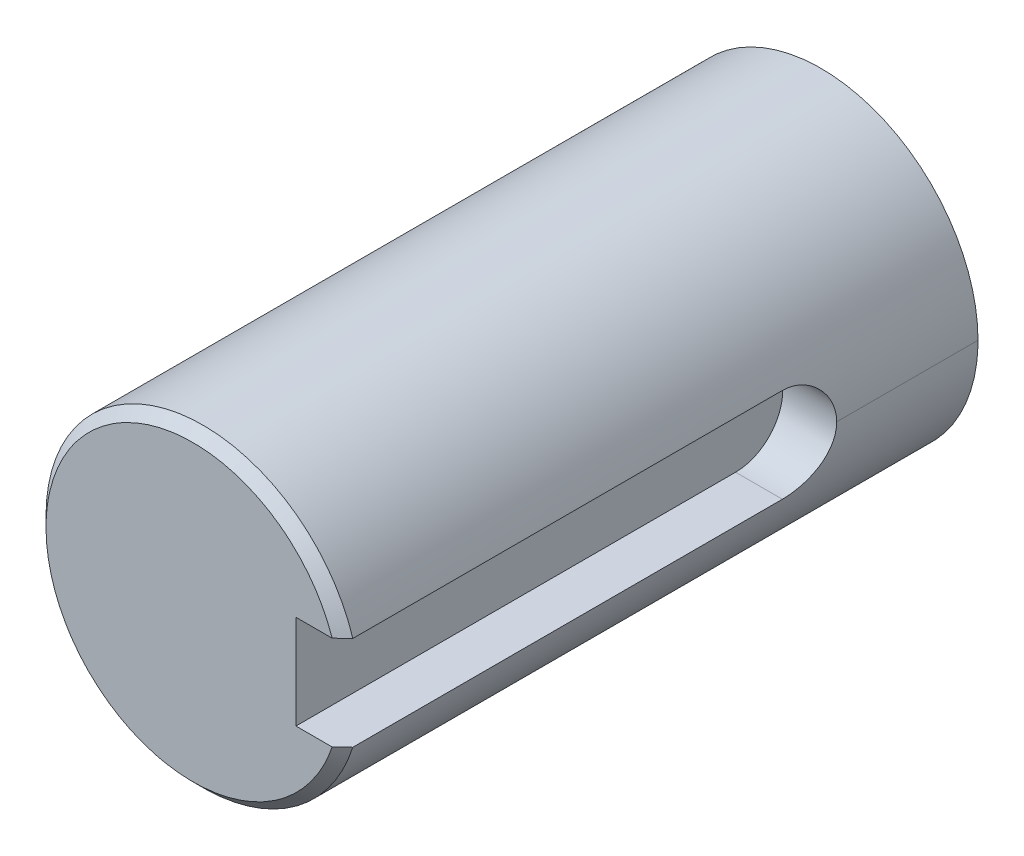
ISO-10303-21;
HEADER;
FILE_DESCRIPTION(('STEP AP214'),'2;1');
FILE_NAME('part.step','',(''),(''),'','','');
FILE_SCHEMA(('AUTOMOTIVE_DESIGN { 1 0 10303 214 1 1 1 1 }'));
ENDSEC;
DATA;
#1=APPLICATION_CONTEXT('core data for automotive mechanical design processes');
#2=APPLICATION_PROTOCOL_DEFINITION('international standard','automotive_design',2000,#1);
#3=PRODUCT_CONTEXT('',#1,'mechanical');
#4=PRODUCT('Part','Part','',(#3));
#5=PRODUCT_RELATED_PRODUCT_CATEGORY('part','',(#4));
#6=PRODUCT_DEFINITION_FORMATION('','',#4);
#7=PRODUCT_DEFINITION_CONTEXT('part definition',#1,'design');
#8=PRODUCT_DEFINITION('design','',#6,#7);
#9=PRODUCT_DEFINITION_SHAPE('','',#8);
#10=(LENGTH_UNIT() NAMED_UNIT(*) SI_UNIT(.MILLI.,.METRE.));
#11=(NAMED_UNIT(*) PLANE_ANGLE_UNIT() SI_UNIT($,.RADIAN.));
#12=(NAMED_UNIT(*) SI_UNIT($,.STERADIAN.) SOLID_ANGLE_UNIT());
#13=UNCERTAINTY_MEASURE_WITH_UNIT(LENGTH_MEASURE(1.E-05),#10,'distance_accuracy_value','');
#14=(GEOMETRIC_REPRESENTATION_CONTEXT(3) GLOBAL_UNCERTAINTY_ASSIGNED_CONTEXT((#13)) GLOBAL_UNIT_ASSIGNED_CONTEXT((#10,
#11,#12)) REPRESENTATION_CONTEXT('',''));
#15=CARTESIAN_POINT('',(0.,0.,0.));
#16=DIRECTION('',(0.,0.,1.));
#17=DIRECTION('',(1.,0.,0.));
#18=AXIS2_PLACEMENT_3D('',#15,#16,#17);
#19=CARTESIAN_POINT('',(0.,0.,31.242));
#20=DIRECTION('',(0.,0.,-1.));
#21=DIRECTION('',(0.,-1.,0.));
#22=AXIS2_PLACEMENT_3D('',#19,#20,#21);
#23=CONICAL_SURFACE('',#22,7.9375,0.785398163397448);
#24=CARTESIAN_POINT('',(7.0375506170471,2.38125,31.75));
#25=CARTESIAN_POINT('',(6.71552573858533,3.33219491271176,31.75));
#26=CARTESIAN_POINT('',(6.19879731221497,4.21681710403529,31.75));
#27=CARTESIAN_POINT('',(4.88401363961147,5.68094219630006,31.75));
#28=CARTESIAN_POINT('',(4.09895487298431,6.27082130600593,31.75));
#29=CARTESIAN_POINT('',(2.39789221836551,7.09247480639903,31.75));
#30=CARTESIAN_POINT('',(1.48896308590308,7.33747211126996,31.75));
#31=CARTESIAN_POINT('',(-0.54073232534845,7.49253715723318,31.75));
#32=CARTESIAN_POINT('',(-1.66639723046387,7.32490888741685,31.75));
#33=CARTESIAN_POINT('',(-3.69381292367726,6.53392238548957,31.75));
#34=CARTESIAN_POINT('',(-4.60143608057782,5.92947145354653,31.75));
#35=CARTESIAN_POINT('',(-6.05321999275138,4.42711020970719,31.75));
#36=CARTESIAN_POINT('',(-6.61001715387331,3.54285966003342,31.75));
#37=CARTESIAN_POINT('',(-7.27179612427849,1.75884452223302,31.75));
#38=CARTESIAN_POINT('',(-7.42952387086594,0.879520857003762,31.75));
#39=CARTESIAN_POINT('',(-7.4295,0.,31.75));
#40=B_SPLINE_CURVE_WITH_KNOTS('',3,(#24,#25,#26,#27,#28,#29,#30,#31,#32,#33,#34,#35,#36,#37,#38,
#39),.UNSPECIFIED.,.F.,.F.,(4,2,2,2,2,2,2,4),(0.,0.144,0.28224,0.4149504,0.57420288,
0.7270852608,0.873852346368,1.),.UNSPECIFIED.);
#41=CARTESIAN_POINT('',(7.0375506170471,2.38125,31.75));
#42=VERTEX_POINT('',#41);
#43=CARTESIAN_POINT('',(-7.4295,0.,31.75));
#44=VERTEX_POINT('',#43);
#45=EDGE_CURVE('E24',#42,#44,#40,.T.);
#46=ORIENTED_EDGE('',*,*,#45,.F.);
#47=CARTESIAN_POINT('',(7.57189241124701,2.38125,31.242));
#48=CARTESIAN_POINT('',(7.53632716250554,2.38125,31.2759270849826));
#49=CARTESIAN_POINT('',(7.50075122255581,2.38125,31.3098428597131));
#50=CARTESIAN_POINT('',(7.42957688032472,2.38125,31.3776510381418));
#51=CARTESIAN_POINT('',(7.39397843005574,2.38125,31.4115434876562));
#52=CARTESIAN_POINT('',(7.32275844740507,2.38125,31.4793037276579));
#53=CARTESIAN_POINT('',(7.28713665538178,2.38125,31.5131717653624));
#54=CARTESIAN_POINT('',(7.21586913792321,2.38125,31.5808820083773));
#55=CARTESIAN_POINT('',(7.18022313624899,2.38125,31.6147244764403));
#56=CARTESIAN_POINT('',(7.10890608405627,2.38125,31.682382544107));
#57=CARTESIAN_POINT('',(7.07323496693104,2.38125,31.7161982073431));
#58=CARTESIAN_POINT('',(7.0375506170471,2.38125,31.75));
#59=B_SPLINE_CURVE_WITH_KNOTS('',3,(#47,#48,#49,#50,#51,#52,#53,#54,#55,#56,#57,#58),
.UNSPECIFIED.,.F.,.F.,(4,2,2,2,2,4),(0.,0.2,0.4,0.6,0.8,1.),.UNSPECIFIED.);
#60=CARTESIAN_POINT('',(7.57189241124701,2.38125,31.242));
#61=VERTEX_POINT('',#60);
#62=EDGE_CURVE('E33',#61,#42,#59,.T.);
#63=ORIENTED_EDGE('',*,*,#62,.F.);
#64=CARTESIAN_POINT('',(-7.9375,0.,31.242));
#65=CARTESIAN_POINT('',(-7.93750075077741,0.0938245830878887,31.242));
#66=CARTESIAN_POINT('',(-7.93583645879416,0.187649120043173,31.242));
#67=CARTESIAN_POINT('',(-7.92918317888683,0.375180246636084,31.242));
#68=CARTESIAN_POINT('',(-7.92419419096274,0.468886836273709,31.242));
#69=CARTESIAN_POINT('',(-7.91089690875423,0.656064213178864,31.242));
#70=CARTESIAN_POINT('',(-7.90258861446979,0.749535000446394,31.242));
#71=CARTESIAN_POINT('',(-7.88266340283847,0.936123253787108,31.242));
#72=CARTESIAN_POINT('',(-7.87104648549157,1.02924071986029,31.242));
#73=CARTESIAN_POINT('',(-7.84451857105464,1.2150052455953,31.242));
#74=CARTESIAN_POINT('',(-7.82960757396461,1.30765230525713,31.242));
#75=CARTESIAN_POINT('',(-7.79651026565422,1.49235952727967,31.242));
#76=CARTESIAN_POINT('',(-7.77832395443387,1.58441968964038,31.242));
#77=CARTESIAN_POINT('',(-7.73869888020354,1.7678373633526,31.242));
#78=CARTESIAN_POINT('',(-7.71726011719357,1.85919487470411,31.242));
#79=CARTESIAN_POINT('',(-7.67115709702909,2.04109237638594,31.242));
#80=CARTESIAN_POINT('',(-7.64649283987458,2.13163236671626,31.242));
#81=CARTESIAN_POINT('',(-7.59396984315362,2.31178098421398,31.242));
#82=CARTESIAN_POINT('',(-7.56611110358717,2.40138961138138,31.242));
#83=CARTESIAN_POINT('',(-7.507234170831,2.57956283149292,31.242));
#84=CARTESIAN_POINT('',(-7.47621597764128,2.66812742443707,31.242));
#85=CARTESIAN_POINT('',(-7.41105913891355,2.84410121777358,31.242));
#86=CARTESIAN_POINT('',(-7.37692049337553,2.93151041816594,31.242));
#87=CARTESIAN_POINT('',(-7.3055656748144,3.10506352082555,31.242));
#88=CARTESIAN_POINT('',(-7.26834950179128,3.19120742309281,31.242));
#89=CARTESIAN_POINT('',(-7.19088642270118,3.36212161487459,31.242));
#90=CARTESIAN_POINT('',(-7.15063951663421,3.44689190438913,31.242));
#91=CARTESIAN_POINT('',(-7.06716557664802,3.61495228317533,31.242));
#92=CARTESIAN_POINT('',(-7.0239385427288,3.69824237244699,31.242));
#93=CARTESIAN_POINT('',(-6.93455869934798,3.8632376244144,31.242));
#94=CARTESIAN_POINT('',(-6.88840588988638,3.94494278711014,31.242));
#95=CARTESIAN_POINT('',(-6.79323252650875,4.10666545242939,31.242));
#96=CARTESIAN_POINT('',(-6.74421197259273,4.1866829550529,31.242));
#97=CARTESIAN_POINT('',(-6.64336475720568,4.34492968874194,31.242));
#98=CARTESIAN_POINT('',(-6.59153809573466,4.42315891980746,31.242));
#99=CARTESIAN_POINT('',(-6.48514383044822,4.5777307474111,31.242));
#100=CARTESIAN_POINT('',(-6.43057622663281,4.65407334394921,31.242));
#101=CARTESIAN_POINT('',(-6.31876868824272,4.80477591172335,31.242));
#102=CARTESIAN_POINT('',(-6.26152875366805,4.87913588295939,31.242));
#103=CARTESIAN_POINT('',(-6.14444852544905,5.02577970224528,31.242));
#104=CARTESIAN_POINT('',(-6.08460823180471,5.09806355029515,31.242));
#105=CARTESIAN_POINT('',(-5.96240252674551,5.24046423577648,31.242));
#106=CARTESIAN_POINT('',(-5.90003711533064,5.31058107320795,31.242));
#107=CARTESIAN_POINT('',(-5.772859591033,5.4485595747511,31.242));
#108=CARTESIAN_POINT('',(-5.70804747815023,5.51642123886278,31.242));
#109=CARTESIAN_POINT('',(-5.57605804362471,5.64980406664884,31.242));
#110=CARTESIAN_POINT('',(-5.50888072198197,5.71532523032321,31.242));
#111=CARTESIAN_POINT('',(-5.37224533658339,5.84394467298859,31.242));
#112=CARTESIAN_POINT('',(-5.30278727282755,5.90704295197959,31.242));
#113=CARTESIAN_POINT('',(-5.16167773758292,6.03073728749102,31.242));
#114=CARTESIAN_POINT('',(-5.09002626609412,6.09133334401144,31.242));
#115=CARTESIAN_POINT('',(-4.94462000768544,6.20994704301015,31.242));
#116=CARTESIAN_POINT('',(-4.87086522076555,6.26796468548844,31.242));
#117=CARTESIAN_POINT('',(-4.7213450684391,6.38134860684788,31.242));
#118=CARTESIAN_POINT('',(-4.64557970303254,6.43671488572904,31.242));
#119=CARTESIAN_POINT('',(-4.49213365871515,6.54472646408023,31.242));
#120=CARTESIAN_POINT('',(-4.41445297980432,6.59737176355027,31.242));
#121=CARTESIAN_POINT('',(-4.25727398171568,6.69987518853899,31.242));
#122=CARTESIAN_POINT('',(-4.17777566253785,6.74973331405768,31.242));
#123=CARTESIAN_POINT('',(-4.01706134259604,6.84659970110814,31.242));
#124=CARTESIAN_POINT('',(-3.93584534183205,6.89360796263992,31.242));
#125=CARTESIAN_POINT('',(-3.77179777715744,6.98471551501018,31.242));
#126=CARTESIAN_POINT('',(-3.68896621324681,7.02881480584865,31.242));
#127=CARTESIAN_POINT('',(-3.52179167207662,7.11404896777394,31.242));
#128=CARTESIAN_POINT('',(-3.43744869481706,7.15518383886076,31.242));
#129=CARTESIAN_POINT('',(-3.26735737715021,7.23443743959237,31.242));
#130=CARTESIAN_POINT('',(-3.18160903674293,7.27255616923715,31.242));
#131=CARTESIAN_POINT('',(-3.00881481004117,7.34572955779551,31.242));
#132=CARTESIAN_POINT('',(-2.9217689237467,7.38078421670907,31.242));
#133=CARTESIAN_POINT('',(-2.74648905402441,7.44778538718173,31.242));
#134=CARTESIAN_POINT('',(-2.65825507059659,7.47973189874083,31.242));
#135=CARTESIAN_POINT('',(-2.48070994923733,7.54047660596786,31.242));
#136=CARTESIAN_POINT('',(-2.39139881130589,7.56927480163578,31.242));
#137=CARTESIAN_POINT('',(-2.21181167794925,7.6236866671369,31.242));
#138=CARTESIAN_POINT('',(-2.12153568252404,7.6493003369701,31.242));
#139=CARTESIAN_POINT('',(-1.9401323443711,7.69731094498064,31.242));
#140=CARTESIAN_POINT('',(-1.84900500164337,7.71970788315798,31.242));
#141=CARTESIAN_POINT('',(-1.66601354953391,7.76125686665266,31.242));
#142=CARTESIAN_POINT('',(-1.57414944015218,7.78040891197,31.242));
#143=CARTESIAN_POINT('',(-1.38979996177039,7.81544402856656,31.242));
#144=CARTESIAN_POINT('',(-1.29731459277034,7.83132709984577,31.242));
#145=CARTESIAN_POINT('',(-1.11183888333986,7.85980429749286,31.242));
#146=CARTESIAN_POINT('',(-1.01884854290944,7.87239842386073,31.242));
#147=CARTESIAN_POINT('',(-0.832479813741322,7.8942818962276,31.242));
#148=CARTESIAN_POINT('',(-0.739101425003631,7.9035712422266,31.242));
#149=CARTESIAN_POINT('',(-0.552074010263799,7.91883347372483,31.242));
#150=CARTESIAN_POINT('',(-0.458424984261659,7.92480635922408,31.242));
#151=CARTESIAN_POINT('',(-0.270974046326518,7.93342815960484,31.242));
#152=CARTESIAN_POINT('',(-0.177172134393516,7.93607707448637,31.242));
#153=CARTESIAN_POINT('',(0.0104666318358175,7.93804760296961,31.242));
#154=CARTESIAN_POINT('',(0.104303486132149,7.93736921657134,31.242));
#155=CARTESIAN_POINT('',(0.291894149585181,7.93268599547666,31.242));
#156=CARTESIAN_POINT('',(0.38564795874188,7.92868116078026,31.242));
#157=CARTESIAN_POINT('',(0.572954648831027,7.91735007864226,31.242));
#158=CARTESIAN_POINT('',(0.666507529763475,7.91002383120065,31.242));
#159=CARTESIAN_POINT('',(0.853294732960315,7.89205913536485,31.242));
#160=CARTESIAN_POINT('',(0.946529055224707,7.88142068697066,31.242));
#161=CARTESIAN_POINT('',(1.13256191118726,7.85684496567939,31.242));
#162=CARTESIAN_POINT('',(1.22536044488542,7.8429076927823,31.242));
#163=CARTESIAN_POINT('',(1.41040504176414,7.81175184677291,31.242));
#164=CARTESIAN_POINT('',(1.5026511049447,7.79453327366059,31.242));
#165=CARTESIAN_POINT('',(1.68647477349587,7.75683647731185,31.242));
#166=CARTESIAN_POINT('',(1.77805237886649,7.73635825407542,31.242));
#167=CARTESIAN_POINT('',(1.96042398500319,7.6921679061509,31.242));
#168=CARTESIAN_POINT('',(2.05121798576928,7.6684557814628,31.242));
#169=CARTESIAN_POINT('',(2.23190822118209,7.61782744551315,31.242));
#170=CARTESIAN_POINT('',(2.32180445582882,7.5909112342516,31.242));
#171=CARTESIAN_POINT('',(2.5005861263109,7.53390856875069,31.242));
#172=CARTESIAN_POINT('',(2.58947156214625,7.50382211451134,31.242));
#173=CARTESIAN_POINT('',(2.76611987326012,7.44051679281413,31.242));
#174=CARTESIAN_POINT('',(2.85388274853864,7.40729792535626,31.242));
#175=CARTESIAN_POINT('',(3.02817558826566,7.33776954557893,31.242));
#176=CARTESIAN_POINT('',(3.11470555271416,7.30146003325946,31.242));
#177=CARTESIAN_POINT('',(3.28642377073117,7.22579601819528,31.242));
#178=CARTESIAN_POINT('',(3.37161202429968,7.18644151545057,31.242));
#179=CARTESIAN_POINT('',(3.54053970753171,7.10473700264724,31.242));
#180=CARTESIAN_POINT('',(3.62427913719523,7.06238699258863,31.242));
#181=CARTESIAN_POINT('',(3.79020388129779,6.97474471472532,31.242));
#182=CARTESIAN_POINT('',(3.87238919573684,6.92945244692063,31.242));
#183=CARTESIAN_POINT('',(4.03510237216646,6.83598260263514,31.242));
#184=CARTESIAN_POINT('',(4.11563023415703,6.78780502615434,31.242));
#185=CARTESIAN_POINT('',(4.2749272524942,6.68862514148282,31.242));
#186=CARTESIAN_POINT('',(4.35369640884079,6.63762283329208,31.242));
#187=CARTESIAN_POINT('',(4.50937697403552,6.53285761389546,31.242));
#188=CARTESIAN_POINT('',(4.58628838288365,6.47909470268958,31.242));
#189=CARTESIAN_POINT('',(4.73815674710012,6.36887587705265,31.242));
#190=CARTESIAN_POINT('',(4.81311370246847,6.31241996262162,31.242));
#191=CARTESIAN_POINT('',(4.96097891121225,6.19688611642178,31.242));
#192=CARTESIAN_POINT('',(5.03388716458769,6.13780818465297,31.242));
#193=CARTESIAN_POINT('',(5.17756329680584,6.01710458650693,31.242));
#194=CARTESIAN_POINT('',(5.24833117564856,5.95547892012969,31.242));
#195=CARTESIAN_POINT('',(5.38763757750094,5.82975733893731,31.242));
#196=CARTESIAN_POINT('',(5.45617610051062,5.76566142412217,31.242));
#197=CARTESIAN_POINT('',(5.59093761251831,5.63507993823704,31.242));
#198=CARTESIAN_POINT('',(5.65716060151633,5.56859436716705,31.242));
#199=CARTESIAN_POINT('',(5.78720777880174,5.43331716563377,31.242));
#200=CARTESIAN_POINT('',(5.85103196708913,5.36452553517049,31.242));
#201=CARTESIAN_POINT('',(5.97620129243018,5.22472271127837,31.242));
#202=CARTESIAN_POINT('',(6.03754642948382,5.15371151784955,31.242));
#203=CARTESIAN_POINT('',(6.15768051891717,5.00955885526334,31.242));
#204=CARTESIAN_POINT('',(6.21646947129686,4.93641738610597,31.242));
#205=CARTESIAN_POINT('',(6.3314172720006,4.78809613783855,31.242));
#206=CARTESIAN_POINT('',(6.38757612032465,4.7129163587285,31.242));
#207=CARTESIAN_POINT('',(6.49719310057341,4.56061301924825,31.242));
#208=CARTESIAN_POINT('',(6.55065123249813,4.48348945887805,31.242));
#209=CARTESIAN_POINT('',(6.65479956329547,4.3273955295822,31.242));
#210=CARTESIAN_POINT('',(6.70548976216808,4.24842516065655,31.242));
#211=CARTESIAN_POINT('',(6.80403849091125,4.08873690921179,31.242));
#212=CARTESIAN_POINT('',(6.8518970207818,4.00801902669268,31.242));
#213=CARTESIAN_POINT('',(6.94472223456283,3.84493723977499,31.242));
#214=CARTESIAN_POINT('',(6.9896889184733,3.76257333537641,31.242));
#215=CARTESIAN_POINT('',(7.07667390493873,3.59630306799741,31.242));
#216=CARTESIAN_POINT('',(7.11869220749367,3.51239670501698,31.242));
#217=CARTESIAN_POINT('',(7.19972758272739,3.3431470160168,31.242));
#218=CARTESIAN_POINT('',(7.23874465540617,3.25780368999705,31.242));
#219=CARTESIAN_POINT('',(7.31372857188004,3.08578740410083,31.242));
#220=CARTESIAN_POINT('',(7.34969541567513,2.99911444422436,31.242));
#221=CARTESIAN_POINT('',(7.41853342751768,2.82454779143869,31.242));
#222=CARTESIAN_POINT('',(7.45140459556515,2.73665409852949,31.242));
#223=CARTESIAN_POINT('',(7.51401075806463,2.55975678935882,31.242));
#224=CARTESIAN_POINT('',(7.54374575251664,2.47075317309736,31.242));
#225=CARTESIAN_POINT('',(7.57189241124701,2.38125,31.242));
#226=B_SPLINE_CURVE_WITH_KNOTS('',3,(#64,#65,#66,#67,#68,#69,#70,#71,#72,#73,#74,#75,#76,#77,
#78,#79,#80,#81,#82,#83,#84,#85,#86,#87,#88,#89,#90,#91,#92,#93,#94,#95,#96,#97,#98,#99,#100,
#101,#102,#103,#104,#105,#106,#107,#108,#109,#110,#111,#112,#113,#114,#115,#116,#117,#118,#119,
#120,#121,#122,#123,#124,#125,#126,#127,#128,#129,#130,#131,#132,#133,#134,#135,#136,#137,#138,
#139,#140,#141,#142,#143,#144,#145,#146,#147,#148,#149,#150,#151,#152,#153,#154,#155,#156,#157,
#158,#159,#160,#161,#162,#163,#164,#165,#166,#167,#168,#169,#170,#171,#172,#173,#174,#175,#176,
#177,#178,#179,#180,#181,#182,#183,#184,#185,#186,#187,#188,#189,#190,#191,#192,#193,#194,#195,
#196,#197,#198,#199,#200,#201,#202,#203,#204,#205,#206,#207,#208,#209,#210,#211,#212,#213,#214,
#215,#216,#217,#218,#219,#220,#221,#222,#223,#224,#225),.UNSPECIFIED.,.F.,.F.,(4,2,2,2,2,2,2,2,
2,2,2,2,2,2,2,2,2,2,2,2,2,2,2,2,2,2,2,2,2,2,2,2,2,2,2,2,2,2,2,2,2,2,2,2,2,2,2,2,2,2,2,2,2,2,2,2,
2,2,2,2,2,2,2,2,2,2,2,2,2,2,2,2,2,2,2,2,2,2,2,2,4),(0.,0.281458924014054,0.562917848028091,
0.844376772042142,1.1258356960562,1.40729462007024,1.68875354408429,1.97021246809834,
2.25167139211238,2.53313031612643,2.81458924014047,3.09604816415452,3.37750708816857,
3.65896601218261,3.94042493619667,4.22188386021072,4.50334278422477,4.78480170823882,
5.06626063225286,5.34771955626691,5.62917848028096,5.91063740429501,6.19209632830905,
6.47355525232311,6.75501417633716,7.0364731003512,7.31793202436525,7.59939094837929,
7.88084987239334,8.16230879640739,8.44376772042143,8.72522664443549,9.00668556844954,
9.28814449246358,9.56960341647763,9.85106234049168,10.1325212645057,10.4139801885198,
10.6954391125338,10.9768980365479,11.2583569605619,11.539815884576,11.82127480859,
12.1027337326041,12.3841926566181,12.6656515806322,12.9471105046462,13.2285694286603,
13.5100283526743,13.7914872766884,14.0729462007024,14.3544051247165,14.6358640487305,
14.9173229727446,15.1987818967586,15.4802408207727,15.7616997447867,16.0431586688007,
16.3246175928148,16.6060765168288,16.8875354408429,17.1689943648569,17.450453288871,
17.731912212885,18.0133711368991,18.2948300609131,18.5762889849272,18.8577479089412,
19.1392068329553,19.4206657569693,19.7021246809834,19.9835836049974,20.2650425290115,
20.5465014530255,20.8279603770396,21.1094193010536,21.3908782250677,21.6723371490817,
21.9537960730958,22.2352549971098,22.5167139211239),.UNSPECIFIED.);
#227=CARTESIAN_POINT('',(-7.9375,0.,31.242));
#228=VERTEX_POINT('',#227);
#229=EDGE_CURVE('E385',#228,#61,#226,.T.);
#230=ORIENTED_EDGE('',*,*,#229,.F.);
#231=CARTESIAN_POINT('',(-7.9375,0.,31.242));
#232=CARTESIAN_POINT('',(-7.93326666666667,0.,31.2462333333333));
#233=CARTESIAN_POINT('',(-7.92903333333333,0.,31.2504666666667));
#234=CARTESIAN_POINT('',(-7.92056666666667,0.,31.2589333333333));
#235=CARTESIAN_POINT('',(-7.91633333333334,0.,31.2631666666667));
#236=CARTESIAN_POINT('',(-7.90786666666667,0.,31.2716333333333));
#237=CARTESIAN_POINT('',(-7.90363333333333,0.,31.2758666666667));
#238=CARTESIAN_POINT('',(-7.89516666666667,0.,31.2843333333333));
#239=CARTESIAN_POINT('',(-7.89093333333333,0.,31.2885666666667));
#240=CARTESIAN_POINT('',(-7.88246666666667,0.,31.2970333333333));
#241=CARTESIAN_POINT('',(-7.87823333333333,0.,31.3012666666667));
#242=CARTESIAN_POINT('',(-7.86976666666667,0.,31.3097333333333));
#243=CARTESIAN_POINT('',(-7.86553333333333,0.,31.3139666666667));
#244=CARTESIAN_POINT('',(-7.85706666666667,0.,31.3224333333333));
#245=CARTESIAN_POINT('',(-7.85283333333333,0.,31.3266666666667));
#246=CARTESIAN_POINT('',(-7.84436666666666,0.,31.3351333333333));
#247=CARTESIAN_POINT('',(-7.84013333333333,0.,31.3393666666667));
#248=CARTESIAN_POINT('',(-7.83166666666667,0.,31.3478333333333));
#249=CARTESIAN_POINT('',(-7.82743333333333,0.,31.3520666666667));
#250=CARTESIAN_POINT('',(-7.81896666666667,0.,31.3605333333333));
#251=CARTESIAN_POINT('',(-7.81473333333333,0.,31.3647666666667));
#252=CARTESIAN_POINT('',(-7.80626666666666,0.,31.3732333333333));
#253=CARTESIAN_POINT('',(-7.80203333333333,0.,31.3774666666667));
#254=CARTESIAN_POINT('',(-7.79356666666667,0.,31.3859333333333));
#255=CARTESIAN_POINT('',(-7.78933333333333,0.,31.3901666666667));
#256=CARTESIAN_POINT('',(-7.78086666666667,0.,31.3986333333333));
#257=CARTESIAN_POINT('',(-7.77663333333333,0.,31.4028666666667));
#258=CARTESIAN_POINT('',(-7.76816666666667,0.,31.4113333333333));
#259=CARTESIAN_POINT('',(-7.76393333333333,0.,31.4155666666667));
#260=CARTESIAN_POINT('',(-7.75546666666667,0.,31.4240333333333));
#261=CARTESIAN_POINT('',(-7.75123333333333,0.,31.4282666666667));
#262=CARTESIAN_POINT('',(-7.74276666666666,0.,31.4367333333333));
#263=CARTESIAN_POINT('',(-7.73853333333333,0.,31.4409666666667));
#264=CARTESIAN_POINT('',(-7.73006666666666,0.,31.4494333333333));
#265=CARTESIAN_POINT('',(-7.72583333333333,0.,31.4536666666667));
#266=CARTESIAN_POINT('',(-7.71736666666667,0.,31.4621333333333));
#267=CARTESIAN_POINT('',(-7.71313333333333,0.,31.4663666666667));
#268=CARTESIAN_POINT('',(-7.70466666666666,0.,31.4748333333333));
#269=CARTESIAN_POINT('',(-7.70043333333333,0.,31.4790666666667));
#270=CARTESIAN_POINT('',(-7.69196666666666,0.,31.4875333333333));
#271=CARTESIAN_POINT('',(-7.68773333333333,0.,31.4917666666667));
#272=CARTESIAN_POINT('',(-7.67926666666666,0.,31.5002333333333));
#273=CARTESIAN_POINT('',(-7.67503333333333,0.,31.5044666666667));
#274=CARTESIAN_POINT('',(-7.66656666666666,0.,31.5129333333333));
#275=CARTESIAN_POINT('',(-7.66233333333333,0.,31.5171666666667));
#276=CARTESIAN_POINT('',(-7.65386666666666,0.,31.5256333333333));
#277=CARTESIAN_POINT('',(-7.64963333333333,0.,31.5298666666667));
#278=CARTESIAN_POINT('',(-7.64116666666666,0.,31.5383333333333));
#279=CARTESIAN_POINT('',(-7.63693333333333,0.,31.5425666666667));
#280=CARTESIAN_POINT('',(-7.62846666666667,0.,31.5510333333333));
#281=CARTESIAN_POINT('',(-7.62423333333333,0.,31.5552666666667));
#282=CARTESIAN_POINT('',(-7.61576666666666,0.,31.5637333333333));
#283=CARTESIAN_POINT('',(-7.61153333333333,0.,31.5679666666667));
#284=CARTESIAN_POINT('',(-7.60306666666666,0.,31.5764333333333));
#285=CARTESIAN_POINT('',(-7.59883333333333,0.,31.5806666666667));
#286=CARTESIAN_POINT('',(-7.59036666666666,0.,31.5891333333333));
#287=CARTESIAN_POINT('',(-7.58613333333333,0.,31.5933666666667));
#288=CARTESIAN_POINT('',(-7.57766666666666,0.,31.6018333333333));
#289=CARTESIAN_POINT('',(-7.57343333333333,0.,31.6060666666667));
#290=CARTESIAN_POINT('',(-7.56496666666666,0.,31.6145333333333));
#291=CARTESIAN_POINT('',(-7.56073333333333,0.,31.6187666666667));
#292=CARTESIAN_POINT('',(-7.55226666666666,0.,31.6272333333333));
#293=CARTESIAN_POINT('',(-7.54803333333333,0.,31.6314666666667));
#294=CARTESIAN_POINT('',(-7.53956666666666,0.,31.6399333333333));
#295=CARTESIAN_POINT('',(-7.53533333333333,0.,31.6441666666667));
#296=CARTESIAN_POINT('',(-7.52686666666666,0.,31.6526333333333));
#297=CARTESIAN_POINT('',(-7.52263333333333,0.,31.6568666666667));
#298=CARTESIAN_POINT('',(-7.51416666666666,0.,31.6653333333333));
#299=CARTESIAN_POINT('',(-7.50993333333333,0.,31.6695666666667));
#300=CARTESIAN_POINT('',(-7.50146666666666,0.,31.6780333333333));
#301=CARTESIAN_POINT('',(-7.49723333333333,0.,31.6822666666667));
#302=CARTESIAN_POINT('',(-7.48876666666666,0.,31.6907333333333));
#303=CARTESIAN_POINT('',(-7.48453333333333,0.,31.6949666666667));
#304=CARTESIAN_POINT('',(-7.47606666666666,0.,31.7034333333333));
#305=CARTESIAN_POINT('',(-7.47183333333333,0.,31.7076666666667));
#306=CARTESIAN_POINT('',(-7.46336666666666,0.,31.7161333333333));
#307=CARTESIAN_POINT('',(-7.45913333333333,0.,31.7203666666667));
#308=CARTESIAN_POINT('',(-7.45066666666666,0.,31.7288333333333));
#309=CARTESIAN_POINT('',(-7.44643333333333,0.,31.7330666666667));
#310=CARTESIAN_POINT('',(-7.43796666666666,0.,31.7415333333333));
#311=CARTESIAN_POINT('',(-7.43373333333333,0.,31.7457666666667));
#312=CARTESIAN_POINT('',(-7.4295,0.,31.75));
#313=B_SPLINE_CURVE_WITH_KNOTS('',3,(#231,#232,#233,#234,#235,#236,#237,#238,#239,#240,#241,
#242,#243,#244,#245,#246,#247,#248,#249,#250,#251,#252,#253,#254,#255,#256,#257,#258,#259,#260,
#261,#262,#263,#264,#265,#266,#267,#268,#269,#270,#271,#272,#273,#274,#275,#276,#277,#278,#279,
#280,#281,#282,#283,#284,#285,#286,#287,#288,#289,#290,#291,#292,#293,#294,#295,#296,#297,#298,
#299,#300,#301,#302,#303,#304,#305,#306,#307,#308,#309,#310,#311,#312),.UNSPECIFIED.,.F.,.F.,(4,
2,2,2,2,2,2,2,2,2,2,2,2,2,2,2,2,2,2,2,2,2,2,2,2,2,2,2,2,2,2,2,2,2,2,2,2,2,2,2,4),(0.,
0.0179605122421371,0.035921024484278,0.0538815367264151,0.0718420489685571,0.089802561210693,
0.107763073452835,0.125723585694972,0.143684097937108,0.16164461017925,0.179605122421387,
0.197565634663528,0.215526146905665,0.233486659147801,0.251447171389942,0.26940768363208,
0.287368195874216,0.305328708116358,0.323289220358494,0.341249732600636,0.359210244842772,
0.377170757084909,0.39513126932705,0.413091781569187,0.431052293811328,0.449012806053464,
0.466973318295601,0.484933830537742,0.502894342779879,0.520854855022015,0.538815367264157,
0.556775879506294,0.574736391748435,0.592696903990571,0.610657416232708,0.62861792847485,
0.646578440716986,0.664538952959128,0.682499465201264,0.700459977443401,0.718420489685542),.UNSPECIFIED.);
#314=EDGE_CURVE('E10',#228,#44,#313,.T.);
#315=ORIENTED_EDGE('',*,*,#314,.T.);
#316=EDGE_LOOP('',(#46,#63,#230,#315));
#317=FACE_BOUND('',#316,.T.);
#318=ADVANCED_FACE('F15',(#317),#23,.T.);
#319=CARTESIAN_POINT('',(-7.42953232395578,-7.5353971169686,31.75));
#320=DIRECTION('',(0.,0.,1.));
#321=DIRECTION('',(1.,0.,0.));
#322=AXIS2_PLACEMENT_3D('',#319,#320,#321);
#323=PLANE('',#322);
#324=ORIENTED_EDGE('',*,*,#45,.T.);
#325=CARTESIAN_POINT('',(-7.4295,0.,31.75));
#326=CARTESIAN_POINT('',(-7.42947918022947,-1.00399436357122,31.75));
#327=CARTESIAN_POINT('',(-7.22335503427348,-2.00758130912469,31.75));
#328=CARTESIAN_POINT('',(-6.44705193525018,-3.81581367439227,31.75));
#329=CARTESIAN_POINT('',(-5.89247168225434,-4.62611739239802,31.75));
#330=CARTESIAN_POINT('',(-4.54458960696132,-5.94973833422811,31.75));
#331=CARTESIAN_POINT('',(-3.76216929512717,-6.4731552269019,31.75));
#332=CARTESIAN_POINT('',(-1.8892907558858,-7.27069474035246,31.75));
#333=CARTESIAN_POINT('',(-0.769250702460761,-7.47257018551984,31.75));
#334=CARTESIAN_POINT('',(1.40473555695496,-7.37308447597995,31.75));
#335=CARTESIAN_POINT('',(2.45824367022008,-7.09156653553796,31.75));
#336=CARTESIAN_POINT('',(4.31502078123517,-6.13387080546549,31.75));
#337=CARTESIAN_POINT('',(5.12582873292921,-5.4746126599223,31.75));
#338=CARTESIAN_POINT('',(6.32438398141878,-3.99672327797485,31.75));
#339=CARTESIAN_POINT('',(6.75544746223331,-3.21430535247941,31.75));
#340=CARTESIAN_POINT('',(7.0375506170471,-2.38125,31.75));
#341=B_SPLINE_CURVE_WITH_KNOTS('',3,(#325,#326,#327,#328,#329,#330,#331,#332,#333,#334,#335,
#336,#337,#338,#339,#340),.UNSPECIFIED.,.F.,.F.,(4,2,2,2,2,2,2,4),(0.,0.144,0.28224,0.4149504,
0.57420288,0.7270852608,0.873852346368,1.),.UNSPECIFIED.);
#342=CARTESIAN_POINT('',(7.0375506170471,-2.38125,31.75));
#343=VERTEX_POINT('',#342);
#344=EDGE_CURVE('E307',#44,#343,#341,.T.);
#345=ORIENTED_EDGE('',*,*,#344,.T.);
#346=CARTESIAN_POINT('',(7.0375506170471,-2.38125,31.75));
#347=CARTESIAN_POINT('',(6.91551390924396,-2.38125,31.75));
#348=CARTESIAN_POINT('',(6.79347720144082,-2.38125,31.75));
#349=CARTESIAN_POINT('',(6.54940378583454,-2.38125,31.75));
#350=CARTESIAN_POINT('',(6.4273670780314,-2.38125,31.75));
#351=CARTESIAN_POINT('',(6.18329366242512,-2.38125,31.75));
#352=CARTESIAN_POINT('',(6.06125695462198,-2.38125,31.75));
#353=CARTESIAN_POINT('',(5.8171835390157,-2.38125,31.75));
#354=CARTESIAN_POINT('',(5.69514683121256,-2.38125,31.75));
#355=CARTESIAN_POINT('',(5.45107341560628,-2.38125,31.75));
#356=CARTESIAN_POINT('',(5.32903670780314,-2.38125,31.75));
#357=CARTESIAN_POINT('',(5.207,-2.38125,31.75));
#358=B_SPLINE_CURVE_WITH_KNOTS('',3,(#346,#347,#348,#349,#350,#351,#352,#353,#354,#355,#356,
#357),.UNSPECIFIED.,.F.,.F.,(4,2,2,2,2,4),(0.,0.2,0.4,0.6,0.8,1.),.UNSPECIFIED.);
#359=CARTESIAN_POINT('',(5.207,-2.38125,31.75));
#360=VERTEX_POINT('',#359);
#361=EDGE_CURVE('E298',#343,#360,#358,.T.);
#362=ORIENTED_EDGE('',*,*,#361,.T.);
#363=CARTESIAN_POINT('',(5.207,-2.38125,31.75));
#364=CARTESIAN_POINT('',(5.207,-2.06375,31.75));
#365=CARTESIAN_POINT('',(5.207,-1.74625,31.75));
#366=CARTESIAN_POINT('',(5.207,-1.11125,31.75));
#367=CARTESIAN_POINT('',(5.207,-0.793749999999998,31.75));
#368=CARTESIAN_POINT('',(5.207,-0.158749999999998,31.75));
#369=CARTESIAN_POINT('',(5.207,0.158750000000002,31.75));
#370=CARTESIAN_POINT('',(5.207,0.793750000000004,31.75));
#371=CARTESIAN_POINT('',(5.207,1.11125,31.75));
#372=CARTESIAN_POINT('',(5.207,1.74625,31.75));
#373=CARTESIAN_POINT('',(5.207,2.06375,31.75));
#374=CARTESIAN_POINT('',(5.207,2.38125,31.75));
#375=B_SPLINE_CURVE_WITH_KNOTS('',3,(#363,#364,#365,#366,#367,#368,#369,#370,#371,#372,#373,
#374),.UNSPECIFIED.,.F.,.F.,(4,2,2,2,2,4),(0.,0.2,0.4,0.6,0.8,1.),.UNSPECIFIED.);
#376=CARTESIAN_POINT('',(5.207,2.38125,31.75));
#377=VERTEX_POINT('',#376);
#378=EDGE_CURVE('E103',#360,#377,#375,.T.);
#379=ORIENTED_EDGE('',*,*,#378,.T.);
#380=CARTESIAN_POINT('',(5.207,2.38125,31.75));
#381=CARTESIAN_POINT('',(5.32903670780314,2.38125,31.75));
#382=CARTESIAN_POINT('',(5.45107341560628,2.38125,31.75));
#383=CARTESIAN_POINT('',(5.69514683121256,2.38125,31.75));
#384=CARTESIAN_POINT('',(5.8171835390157,2.38125,31.75));
#385=CARTESIAN_POINT('',(6.06125695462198,2.38125,31.75));
#386=CARTESIAN_POINT('',(6.18329366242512,2.38125,31.75));
#387=CARTESIAN_POINT('',(6.4273670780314,2.38125,31.75));
#388=CARTESIAN_POINT('',(6.54940378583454,2.38125,31.75));
#389=CARTESIAN_POINT('',(6.79347720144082,2.38125,31.75));
#390=CARTESIAN_POINT('',(6.91551390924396,2.38125,31.75));
#391=CARTESIAN_POINT('',(7.0375506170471,2.38125,31.75));
#392=B_SPLINE_CURVE_WITH_KNOTS('',3,(#380,#381,#382,#383,#384,#385,#386,#387,#388,#389,#390,
#391),.UNSPECIFIED.,.F.,.F.,(4,2,2,2,2,4),(0.,0.2,0.4,0.6,0.8,1.),.UNSPECIFIED.);
#393=EDGE_CURVE('E498',#377,#42,#392,.T.);
#394=ORIENTED_EDGE('',*,*,#393,.T.);
#395=EDGE_LOOP('',(#324,#345,#362,#379,#394));
#396=FACE_BOUND('',#395,.T.);
#397=ADVANCED_FACE('F257',(#396),#323,.T.);
#398=CARTESIAN_POINT('',(5.207,2.38125,9.525));
#399=DIRECTION('',(0.,-1.,0.));
#400=DIRECTION('',(1.,0.,0.));
#401=AXIS2_PLACEMENT_3D('',#398,#399,#400);
#402=PLANE('',#401);
#403=ORIENTED_EDGE('',*,*,#62,.T.);
#404=ORIENTED_EDGE('',*,*,#393,.F.);
#405=CARTESIAN_POINT('',(5.207,2.38124173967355,9.52500000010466));
#406=CARTESIAN_POINT('',(5.207,2.38124680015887,11.0066666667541));
#407=CARTESIAN_POINT('',(5.207,2.3812503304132,12.4883333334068));
#408=CARTESIAN_POINT('',(5.207,2.38125548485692,15.4516666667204));
#409=CARTESIAN_POINT('',(5.207,2.38125700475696,16.9333333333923));
#410=CARTESIAN_POINT('',(5.207,2.38125845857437,19.8966666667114));
#411=CARTESIAN_POINT('',(5.207,2.38125839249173,21.3783333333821));
#412=CARTESIAN_POINT('',(5.207,2.38125720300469,24.3416666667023));
#413=CARTESIAN_POINT('',(5.207,2.38125607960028,25.8233333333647));
#414=CARTESIAN_POINT('',(5.207,2.38125330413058,28.7866666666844));
#415=CARTESIAN_POINT('',(5.207,2.38125165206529,30.2683333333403));
#416=CARTESIAN_POINT('',(5.207,2.38125,31.75));
#417=B_SPLINE_CURVE_WITH_KNOTS('',3,(#405,#406,#407,#408,#409,#410,#411,#412,#413,#414,#415,
#416),.UNSPECIFIED.,.F.,.F.,(4,2,2,2,2,4),(0.,0.2,0.4,0.6,0.8,1.),.UNSPECIFIED.);
#418=CARTESIAN_POINT('',(5.207,2.38124173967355,9.52500000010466));
#419=VERTEX_POINT('',#418);
#420=EDGE_CURVE('E112',#419,#377,#417,.T.);
#421=ORIENTED_EDGE('',*,*,#420,.F.);
#422=CARTESIAN_POINT('',(7.57189241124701,2.38125,9.525));
#423=CARTESIAN_POINT('',(7.5521849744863,2.38125,9.52500000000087));
#424=CARTESIAN_POINT('',(7.53247753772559,2.38125,9.52500000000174));
#425=CARTESIAN_POINT('',(7.49306266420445,2.38125,9.52500000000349));
#426=CARTESIAN_POINT('',(7.47335522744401,2.38125,9.52500000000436));
#427=CARTESIAN_POINT('',(7.43394035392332,2.38125,9.52500000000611));
#428=CARTESIAN_POINT('',(7.41423291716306,2.38125,9.52500000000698));
#429=CARTESIAN_POINT('',(7.37481804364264,2.38125,9.52500000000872));
#430=CARTESIAN_POINT('',(7.35511060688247,2.38125,9.52500000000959));
#431=CARTESIAN_POINT('',(7.31569573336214,2.38125,9.52500000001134));
#432=CARTESIAN_POINT('',(7.29598829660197,2.38125,9.52500000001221));
#433=CARTESIAN_POINT('',(7.25657342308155,2.38125,9.52500000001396));
#434=CARTESIAN_POINT('',(7.23686598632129,2.38125,9.52500000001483));
#435=CARTESIAN_POINT('',(7.1974511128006,2.38125,9.52500000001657));
#436=CARTESIAN_POINT('',(7.17774367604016,2.38125,9.52500000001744));
#437=CARTESIAN_POINT('',(7.13832880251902,2.38125,9.52500000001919));
#438=CARTESIAN_POINT('',(7.11862136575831,2.38125,9.52500000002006));
#439=CARTESIAN_POINT('',(7.0792064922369,2.38125,9.52500000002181));
#440=CARTESIAN_POINT('',(7.05949905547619,2.38125,9.52500000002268));
#441=CARTESIAN_POINT('',(7.02008418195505,2.38125,9.52500000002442));
#442=CARTESIAN_POINT('',(7.00037674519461,2.38125,9.52500000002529));
#443=CARTESIAN_POINT('',(6.96096187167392,2.38125,9.52500000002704));
#444=CARTESIAN_POINT('',(6.94125443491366,2.38125,9.52500000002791));
#445=CARTESIAN_POINT('',(6.90183956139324,2.38125,9.52500000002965));
#446=CARTESIAN_POINT('',(6.88213212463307,2.38125,9.52500000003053));
#447=CARTESIAN_POINT('',(6.84271725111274,2.38125,9.52500000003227));
#448=CARTESIAN_POINT('',(6.82300981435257,2.38125,9.52500000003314));
#449=CARTESIAN_POINT('',(6.78359494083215,2.38125,9.52500000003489));
#450=CARTESIAN_POINT('',(6.76388750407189,2.38125,9.52500000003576));
#451=CARTESIAN_POINT('',(6.7244726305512,2.38125,9.5250000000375));
#452=CARTESIAN_POINT('',(6.70476519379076,2.38125,9.52500000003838));
#453=CARTESIAN_POINT('',(6.66535032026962,2.38125,9.52500000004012));
#454=CARTESIAN_POINT('',(6.64564288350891,2.38125,9.52500000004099));
#455=CARTESIAN_POINT('',(6.6062280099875,2.38125,9.52500000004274));
#456=CARTESIAN_POINT('',(6.58652057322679,2.38125,9.52500000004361));
#457=CARTESIAN_POINT('',(6.54710569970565,2.38125,9.52500000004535));
#458=CARTESIAN_POINT('',(6.52739826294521,2.38125,9.52500000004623));
#459=CARTESIAN_POINT('',(6.48798338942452,2.38125,9.52500000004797));
#460=CARTESIAN_POINT('',(6.46827595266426,2.38125,9.52500000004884));
#461=CARTESIAN_POINT('',(6.42886107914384,2.38125,9.52500000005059));
#462=CARTESIAN_POINT('',(6.40915364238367,2.38125,9.52500000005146));
#463=CARTESIAN_POINT('',(6.36973876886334,2.38125,9.5250000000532));
#464=CARTESIAN_POINT('',(6.35003133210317,2.38125,9.52500000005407));
#465=CARTESIAN_POINT('',(6.31061645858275,2.38125,9.52500000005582));
#466=CARTESIAN_POINT('',(6.29090902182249,2.38125,9.52500000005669));
#467=CARTESIAN_POINT('',(6.2514941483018,2.38125,9.52500000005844));
#468=CARTESIAN_POINT('',(6.23178671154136,2.38125,9.52500000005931));
#469=CARTESIAN_POINT('',(6.19237183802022,2.38125,9.52500000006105));
#470=CARTESIAN_POINT('',(6.17266440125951,2.38125,9.52500000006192));
#471=CARTESIAN_POINT('',(6.1332495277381,2.38125,9.52500000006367));
#472=CARTESIAN_POINT('',(6.11354209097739,2.38125,9.52500000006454));
#473=CARTESIAN_POINT('',(6.07412721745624,2.38125,9.52500000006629));
#474=CARTESIAN_POINT('',(6.05441978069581,2.38125,9.52500000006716));
#475=CARTESIAN_POINT('',(6.01500490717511,2.38125,9.5250000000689));
#476=CARTESIAN_POINT('',(5.99529747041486,2.38125,9.52500000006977));
#477=CARTESIAN_POINT('',(5.95588259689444,2.38125,9.52500000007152));
#478=CARTESIAN_POINT('',(5.93617516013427,2.38125,9.52500000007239));
#479=CARTESIAN_POINT('',(5.89676028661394,2.38125,9.52500000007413));
#480=CARTESIAN_POINT('',(5.87705284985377,2.38125,9.52500000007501));
#481=CARTESIAN_POINT('',(5.83763797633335,2.38125,9.52500000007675));
#482=CARTESIAN_POINT('',(5.81793053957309,2.38125,9.52500000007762));
#483=CARTESIAN_POINT('',(5.7785156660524,2.38125,9.52500000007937));
#484=CARTESIAN_POINT('',(5.75880822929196,2.38125,9.52500000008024));
#485=CARTESIAN_POINT('',(5.71939335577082,2.38125,9.52500000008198));
#486=CARTESIAN_POINT('',(5.69968591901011,2.38125,9.52500000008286));
#487=CARTESIAN_POINT('',(5.66027104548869,2.38125,9.5250000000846));
#488=CARTESIAN_POINT('',(5.64056360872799,2.38125,9.52500000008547));
#489=CARTESIAN_POINT('',(5.60114873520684,2.38125,9.52500000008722));
#490=CARTESIAN_POINT('',(5.58144129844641,2.38125,9.52500000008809));
#491=CARTESIAN_POINT('',(5.54202642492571,2.38125,9.52500000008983));
#492=CARTESIAN_POINT('',(5.52231898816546,2.38125,9.52500000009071));
#493=CARTESIAN_POINT('',(5.48290411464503,2.38125,9.52500000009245));
#494=CARTESIAN_POINT('',(5.46319667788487,2.38125,9.52500000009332));
#495=CARTESIAN_POINT('',(5.42378180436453,2.38125,9.52500000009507));
#496=CARTESIAN_POINT('',(5.40407436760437,2.38125,9.52500000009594));
#497=CARTESIAN_POINT('',(5.36465949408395,2.38125,9.52500000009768));
#498=CARTESIAN_POINT('',(5.34495205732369,2.38125,9.52500000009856));
#499=CARTESIAN_POINT('',(5.305537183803,2.38125,9.5250000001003));
#500=CARTESIAN_POINT('',(5.28582974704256,2.38125,9.52500000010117));
#501=CARTESIAN_POINT('',(5.24641487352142,2.38125,9.52500000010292));
#502=CARTESIAN_POINT('',(5.22670743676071,2.38125,9.52500000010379));
#503=CARTESIAN_POINT('',(5.207,2.38125,9.52500000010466));
#504=B_SPLINE_CURVE_WITH_KNOTS('',3,(#422,#423,#424,#425,#426,#427,#428,#429,#430,#431,#432,
#433,#434,#435,#436,#437,#438,#439,#440,#441,#442,#443,#444,#445,#446,#447,#448,#449,#450,#451,
#452,#453,#454,#455,#456,#457,#458,#459,#460,#461,#462,#463,#464,#465,#466,#467,#468,#469,#470,
#471,#472,#473,#474,#475,#476,#477,#478,#479,#480,#481,#482,#483,#484,#485,#486,#487,#488,#489,
#490,#491,#492,#493,#494,#495,#496,#497,#498,#499,#500,#501,#502,#503),.UNSPECIFIED.,.F.,.F.,(4,
2,2,2,2,2,2,2,2,2,2,2,2,2,2,2,2,2,2,2,2,2,2,2,2,2,2,2,2,2,2,2,2,2,2,2,2,2,2,2,4),(0.,
0.059122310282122,0.118244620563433,0.177366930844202,0.236489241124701,0.2956115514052,
0.354733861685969,0.41385617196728,0.472978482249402,0.532100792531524,0.591223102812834,
0.650345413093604,0.709467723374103,0.768590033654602,0.827712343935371,0.886834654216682,
0.945956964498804,1.00507927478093,1.06420158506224,1.12332389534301,1.1824462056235,
1.241568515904,1.30069082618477,1.35981313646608,1.4189354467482,1.47805775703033,
1.53718006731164,1.59630237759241,1.65542468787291,1.71454699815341,1.77366930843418,
1.83279161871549,1.89191392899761,1.95103623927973,2.01015854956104,2.06928085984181,
2.12840317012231,2.18752548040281,2.24664779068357,2.30577010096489,2.36489241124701),.UNSPECIFIED.);
#505=CARTESIAN_POINT('',(7.57189241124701,2.38125,9.525));
#506=VERTEX_POINT('',#505);
#507=EDGE_CURVE('E110',#506,#419,#504,.T.);
#508=ORIENTED_EDGE('',*,*,#507,.F.);
#509=CARTESIAN_POINT('',(7.57189241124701,2.38125,31.242));
#510=CARTESIAN_POINT('',(7.57189241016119,2.38125000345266,31.061025));
#511=CARTESIAN_POINT('',(7.57189240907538,2.38125000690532,30.88005));
#512=CARTESIAN_POINT('',(7.57189240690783,2.38125001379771,30.5181));
#513=CARTESIAN_POINT('',(7.57189240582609,2.38125001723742,30.337125));
#514=CARTESIAN_POINT('',(7.57189240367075,2.38125002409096,29.975175));
#515=CARTESIAN_POINT('',(7.57189240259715,2.38125002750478,29.7942));
#516=CARTESIAN_POINT('',(7.57189240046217,2.38125003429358,29.43225));
#517=CARTESIAN_POINT('',(7.57189239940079,2.38125003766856,29.251275));
#518=CARTESIAN_POINT('',(7.57189239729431,2.38125004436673,28.889325));
#519=CARTESIAN_POINT('',(7.57189239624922,2.38125004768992,28.7083499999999));
#520=CARTESIAN_POINT('',(7.57189239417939,2.38125005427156,28.3463999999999));
#521=CARTESIAN_POINT('',(7.57189239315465,2.38125005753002,28.1654249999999));
#522=CARTESIAN_POINT('',(7.57189239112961,2.38125006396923,27.8034749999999));
#523=CARTESIAN_POINT('',(7.57189239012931,2.38125006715,27.6224999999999));
#524=CARTESIAN_POINT('',(7.5718923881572,2.3812500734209,27.2605499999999));
#525=CARTESIAN_POINT('',(7.5718923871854,2.38125007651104,27.0795749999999));
#526=CARTESIAN_POINT('',(7.57189238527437,2.38125008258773,26.7176249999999));
#527=CARTESIAN_POINT('',(7.57189238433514,2.38125008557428,26.5366499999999));
#528=CARTESIAN_POINT('',(7.57189238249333,2.38125009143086,26.1746999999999));
#529=CARTESIAN_POINT('',(7.57189238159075,2.38125009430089,25.9937249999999));
#530=CARTESIAN_POINT('',(7.5718923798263,2.38125009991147,25.6317749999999));
#531=CARTESIAN_POINT('',(7.57189237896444,2.38125010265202,25.4507999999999));
#532=CARTESIAN_POINT('',(7.5718923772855,2.3812501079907,25.0888499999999));
#533=CARTESIAN_POINT('',(7.57189237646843,2.38125011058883,24.9078749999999));
#534=CARTESIAN_POINT('',(7.57189237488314,2.38125011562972,24.5459249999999));
#535=CARTESIAN_POINT('',(7.57189237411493,2.38125011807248,24.3649499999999));
#536=CARTESIAN_POINT('',(7.57189237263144,2.38125012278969,24.0029999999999));
#537=CARTESIAN_POINT('',(7.57189237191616,2.38125012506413,23.8220249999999));
#538=CARTESIAN_POINT('',(7.5718923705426,2.38125012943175,23.4600749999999));
#539=CARTESIAN_POINT('',(7.57189236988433,2.38125013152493,23.2790999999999));
#540=CARTESIAN_POINT('',(7.57189236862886,2.38125013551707,22.9171499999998));
#541=CARTESIAN_POINT('',(7.57189236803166,2.38125013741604,22.7361749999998));
#542=CARTESIAN_POINT('',(7.57189236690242,2.38125014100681,22.3742249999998));
#543=CARTESIAN_POINT('',(7.57189236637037,2.38125014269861,22.1932499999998));
#544=CARTESIAN_POINT('',(7.57189236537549,2.38125014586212,21.8312999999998));
#545=CARTESIAN_POINT('',(7.57189236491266,2.38125014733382,21.6503249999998));
#546=CARTESIAN_POINT('',(7.5718923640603,2.38125015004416,21.2883749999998));
#547=CARTESIAN_POINT('',(7.57189236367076,2.3812501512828,21.1073999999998));
#548=CARTESIAN_POINT('',(7.57189236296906,2.38125015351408,20.7454499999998));
#549=CARTESIAN_POINT('',(7.57189236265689,2.38125015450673,20.5644749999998));
#550=CARTESIAN_POINT('',(7.57189236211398,2.38125015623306,20.2025249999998));
#551=CARTESIAN_POINT('',(7.57189236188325,2.38125015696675,20.0215499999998));
#552=CARTESIAN_POINT('',(7.57189236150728,2.38125015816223,19.6595999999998));
#553=CARTESIAN_POINT('',(7.57189236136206,2.38125015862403,19.4786249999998));
#554=CARTESIAN_POINT('',(7.57189236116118,2.38125015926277,19.1166749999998));
#555=CARTESIAN_POINT('',(7.57189236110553,2.38125015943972,18.9356999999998));
#556=CARTESIAN_POINT('',(7.57189236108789,2.38125015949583,18.5737499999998));
#557=CARTESIAN_POINT('',(7.57189236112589,2.38125015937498,18.3927749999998));
#558=CARTESIAN_POINT('',(7.57189236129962,2.38125015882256,18.0308249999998));
#559=CARTESIAN_POINT('',(7.57189236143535,2.38125015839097,17.8498499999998));
#560=CARTESIAN_POINT('',(7.5718923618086,2.38125015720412,17.4878999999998));
#561=CARTESIAN_POINT('',(7.57189236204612,2.38125015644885,17.3069249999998));
#562=CARTESIAN_POINT('',(7.57189236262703,2.38125015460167,16.9449749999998));
#563=CARTESIAN_POINT('',(7.57189236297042,2.38125015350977,16.7639999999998));
#564=CARTESIAN_POINT('',(7.57189236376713,2.38125015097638,16.4020499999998));
#565=CARTESIAN_POINT('',(7.57189236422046,2.38125014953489,16.2210749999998));
#566=CARTESIAN_POINT('',(7.57189236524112,2.38125014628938,15.8591249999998));
#567=CARTESIAN_POINT('',(7.57189236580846,2.38125014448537,15.6781499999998));
#568=CARTESIAN_POINT('',(7.57189236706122,2.38125014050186,15.3161999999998));
#569=CARTESIAN_POINT('',(7.57189236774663,2.38125013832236,15.1352249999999));
#570=CARTESIAN_POINT('',(7.57189236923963,2.38125013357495,14.7732749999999));
#571=CARTESIAN_POINT('',(7.5718923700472,2.38125013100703,14.5922999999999));
#572=CARTESIAN_POINT('',(7.57189237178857,2.38125012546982,14.2303499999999));
#573=CARTESIAN_POINT('',(7.57189237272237,2.38125012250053,14.0493749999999));
#574=CARTESIAN_POINT('',(7.57189237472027,2.38125011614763,13.6874249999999));
#575=CARTESIAN_POINT('',(7.57189237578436,2.38125011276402,13.5064499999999));
#576=CARTESIAN_POINT('',(7.57189237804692,2.38125010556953,13.1444999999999));
#577=CARTESIAN_POINT('',(7.57189237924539,2.38125010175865,12.9635249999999));
#578=CARTESIAN_POINT('',(7.57189238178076,2.38125009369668,12.6015749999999));
#579=CARTESIAN_POINT('',(7.57189238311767,2.38125008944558,12.4205999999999));
#580=CARTESIAN_POINT('',(7.571892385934,2.38125008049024,12.0586499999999));
#581=CARTESIAN_POINT('',(7.57189238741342,2.38125007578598,11.8776749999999));
#582=CARTESIAN_POINT('',(7.57189239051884,2.38125006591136,11.5157249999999));
#583=CARTESIAN_POINT('',(7.57189239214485,2.381250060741,11.3347499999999));
#584=CARTESIAN_POINT('',(7.57189239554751,2.38125004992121,10.9728));
#585=CARTESIAN_POINT('',(7.57189239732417,2.38125004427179,10.791825));
#586=CARTESIAN_POINT('',(7.57189240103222,2.38125003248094,10.429875));
#587=CARTESIAN_POINT('',(7.57189240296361,2.38125002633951,10.2489));
#588=CARTESIAN_POINT('',(7.57189240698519,2.38125001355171,9.88695));
#589=CARTESIAN_POINT('',(7.57189240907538,2.38125000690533,9.705975));
#590=CARTESIAN_POINT('',(7.57189241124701,2.38125,9.525));
#591=B_SPLINE_CURVE_WITH_KNOTS('',3,(#509,#510,#511,#512,#513,#514,#515,#516,#517,#518,#519,
#520,#521,#522,#523,#524,#525,#526,#527,#528,#529,#530,#531,#532,#533,#534,#535,#536,#537,#538,
#539,#540,#541,#542,#543,#544,#545,#546,#547,#548,#549,#550,#551,#552,#553,#554,#555,#556,#557,
#558,#559,#560,#561,#562,#563,#564,#565,#566,#567,#568,#569,#570,#571,#572,#573,#574,#575,#576,
#577,#578,#579,#580,#581,#582,#583,#584,#585,#586,#587,#588,#589,#590),.UNSPECIFIED.,.F.,.F.,(4,
2,2,2,2,2,2,2,2,2,2,2,2,2,2,2,2,2,2,2,2,2,2,2,2,2,2,2,2,2,2,2,2,2,2,2,2,2,2,2,4),(0.,0.542925,
1.08585000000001,1.62877500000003,2.17170000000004,2.71462500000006,3.25755000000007,
3.80047500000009,4.34340000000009,4.8863250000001,5.42925000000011,5.9721750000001,
6.51510000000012,7.05802500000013,7.60095000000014,8.14387500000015,8.68680000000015,
9.22972500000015,9.77265000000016,10.3155750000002,10.8585000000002,11.4014250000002,
11.9443500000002,12.4872750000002,13.0302000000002,13.5731250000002,14.1160500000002,
14.6589750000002,15.2019000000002,15.7448250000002,16.2877500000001,16.8306750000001,
17.3736000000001,17.9165250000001,18.4594500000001,19.0023750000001,19.5453000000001,
20.0882250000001,20.63115,21.174075,21.717),.UNSPECIFIED.);
#592=EDGE_CURVE('E420',#61,#506,#591,.T.);
#593=ORIENTED_EDGE('',*,*,#592,.F.);
#594=EDGE_LOOP('',(#403,#404,#421,#508,#593));
#595=FACE_BOUND('',#594,.T.);
#596=ADVANCED_FACE('F260',(#595),#402,.T.);
#597=CARTESIAN_POINT('',(0.,0.,0.));
#598=DIRECTION('',(0.,0.,1.));
#599=DIRECTION('',(1.,0.,0.));
#600=AXIS2_PLACEMENT_3D('',#597,#598,#599);
#601=CYLINDRICAL_SURFACE('',#600,7.9375);
#602=ORIENTED_EDGE('',*,*,#229,.T.);
#603=ORIENTED_EDGE('',*,*,#592,.T.);
#604=CARTESIAN_POINT('',(7.57189241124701,2.38125,9.525));
#605=CARTESIAN_POINT('',(7.57189241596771,2.38124991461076,9.50963784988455));
#606=CARTESIAN_POINT('',(7.57194187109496,2.3810927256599,9.49427581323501));
#607=CARTESIAN_POINT('',(7.57213854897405,2.38046723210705,9.46347933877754));
#608=CARTESIAN_POINT('',(7.57228627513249,2.37999732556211,9.44804493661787));
#609=CARTESIAN_POINT('',(7.57267928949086,2.37874652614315,9.41711437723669));
#610=CARTESIAN_POINT('',(7.57292505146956,2.37796412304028,9.40161828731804));
#611=CARTESIAN_POINT('',(7.57351382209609,2.37608830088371,9.37057492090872));
#612=CARTESIAN_POINT('',(7.57385727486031,2.37499346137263,9.35502773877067));
#613=CARTESIAN_POINT('',(7.57464099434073,2.37249273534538,9.32389278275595));
#614=CARTESIAN_POINT('',(7.57508167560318,2.3710855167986,9.30830512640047));
#615=CARTESIAN_POINT('',(7.57605930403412,2.36795995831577,9.27709981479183));
#616=CARTESIAN_POINT('',(7.5765966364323,2.3662403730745,9.2614822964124));
#617=CARTESIAN_POINT('',(7.57776690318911,2.36248997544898,9.23022785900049));
#618=CARTESIAN_POINT('',(7.57840019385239,2.36045800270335,9.21459109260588));
#619=CARTESIAN_POINT('',(7.57976159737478,2.35608269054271,9.1833087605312));
#620=CARTESIAN_POINT('',(7.58049003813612,2.35373827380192,9.16766335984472));
#621=CARTESIAN_POINT('',(7.582040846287,2.34873790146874,9.13637436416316));
#622=CARTESIAN_POINT('',(7.58286351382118,2.34608094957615,9.12073094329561));
#623=CARTESIAN_POINT('',(7.58460176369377,2.34045530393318,9.08945651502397));
#624=CARTESIAN_POINT('',(7.58551761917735,2.33748569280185,9.07382568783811));
#625=CARTESIAN_POINT('',(7.58744111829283,2.33123449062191,9.04258705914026));
#626=CARTESIAN_POINT('',(7.58844900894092,2.3279520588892,9.02697944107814));
#627=CARTESIAN_POINT('',(7.59055533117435,2.32107496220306,8.99579784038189));
#628=CARTESIAN_POINT('',(7.59165398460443,2.31747953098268,8.98022404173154));
#629=CARTESIAN_POINT('',(7.59394048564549,2.30997609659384,8.94912071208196));
#630=CARTESIAN_POINT('',(7.59512853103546,2.30606739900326,8.93359136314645));
#631=CARTESIAN_POINT('',(7.59759229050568,2.29793727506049,8.90258749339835));
#632=CARTESIAN_POINT('',(7.59886817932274,2.29371522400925,8.88711315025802));
#633=CARTESIAN_POINT('',(7.60150621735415,2.28495742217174,8.85623013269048));
#634=CARTESIAN_POINT('',(7.60286851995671,2.28042111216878,8.84082162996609));
#635=CARTESIAN_POINT('',(7.60567698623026,2.27103674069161,8.81008009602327));
#636=CARTESIAN_POINT('',(7.60712328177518,2.26618818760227,8.79474722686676));
#637=CARTESIAN_POINT('',(7.61010074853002,2.25616936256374,8.76416799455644));
#638=CARTESIAN_POINT('',(7.61163205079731,2.25099859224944,8.74892180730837));
#639=CARTESIAN_POINT('',(7.61477831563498,2.24033220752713,8.71852734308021));
#640=CARTESIAN_POINT('',(7.61639339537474,2.23483613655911,8.70337923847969));
#641=CARTESIAN_POINT('',(7.61970236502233,2.22352802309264,8.6731920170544));
#642=CARTESIAN_POINT('',(7.62139633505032,2.21771565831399,8.65815302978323));
#643=CARTESIAN_POINT('',(7.62485905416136,2.20578087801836,8.62819620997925));
#644=CARTESIAN_POINT('',(7.62662784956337,2.1996582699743,8.6132784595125));
#645=CARTESIAN_POINT('',(7.63023590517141,2.18710971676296,8.58357599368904));
#646=CARTESIAN_POINT('',(7.63207518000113,2.18068370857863,8.56879130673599));
#647=CARTESIAN_POINT('',(7.63581990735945,2.16753484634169,8.53936694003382));
#648=CARTESIAN_POINT('',(7.63772534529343,2.16081205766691,8.5247272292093));
#649=CARTESIAN_POINT('',(7.64159805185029,2.14707623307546,8.4956047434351));
#650=CARTESIAN_POINT('',(7.64356527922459,2.14006338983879,8.4811218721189));
#651=CARTESIAN_POINT('',(7.64755724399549,2.12575388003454,8.45232511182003));
#652=CARTESIAN_POINT('',(7.64958191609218,2.11845753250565,8.43801105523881));
#653=CARTESIAN_POINT('',(7.6536842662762,2.10358807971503,8.40956357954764));
#654=CARTESIAN_POINT('',(7.65576185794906,2.0960154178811,8.39542991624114));
#655=CARTESIAN_POINT('',(7.65996622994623,2.08059781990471,8.36735588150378));
#656=CARTESIAN_POINT('',(7.66209290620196,2.0727534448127,8.35341518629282));
#657=CARTESIAN_POINT('',(7.66638897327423,2.05680685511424,8.3257264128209));
#658=CARTESIAN_POINT('',(7.66855827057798,2.04870518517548,8.3119780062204));
#659=CARTESIAN_POINT('',(7.67293525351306,2.0322507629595,8.28467827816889));
#660=CARTESIAN_POINT('',(7.67514284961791,2.02389856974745,8.27112660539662));
#661=CARTESIAN_POINT('',(7.67959204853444,2.0069501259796,8.24422581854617));
#662=CARTESIAN_POINT('',(7.68183356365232,1.99835446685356,8.23087631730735));
#663=CARTESIAN_POINT('',(7.68634624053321,1.98092618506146,8.20438529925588));
#664=CARTESIAN_POINT('',(7.68861731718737,1.97209418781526,8.1912433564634));
#665=CARTESIAN_POINT('',(7.69318479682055,1.95420034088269,8.1651728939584));
#666=CARTESIAN_POINT('',(7.69548111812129,1.94513915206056,8.15224390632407));
#667=CARTESIAN_POINT('',(7.70009481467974,1.92679404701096,8.12660480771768));
#668=CARTESIAN_POINT('',(7.70241211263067,1.91751082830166,8.11389418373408));
#669=CARTESIAN_POINT('',(7.70706352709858,1.89872887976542,8.08869721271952));
#670=CARTESIAN_POINT('',(7.70939757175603,1.88923088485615,8.07621030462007));
#671=CARTESIAN_POINT('',(7.71407789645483,1.87002828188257,8.05146880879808));
#672=CARTESIAN_POINT('',(7.71642410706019,1.86032449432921,8.03921357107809));
#673=CARTESIAN_POINT('',(7.72112057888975,1.84073468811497,8.01495855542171));
#674=CARTESIAN_POINT('',(7.72347075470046,1.83084988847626,8.00295777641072));
#675=CARTESIAN_POINT('',(7.72817217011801,1.81090187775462,7.97921470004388));
#676=CARTESIAN_POINT('',(7.7305233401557,1.80083986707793,7.96747138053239));
#677=CARTESIAN_POINT('',(7.7352247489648,1.78053710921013,7.9442398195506));
#678=CARTESIAN_POINT('',(7.73757493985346,1.77029742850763,7.93275063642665));
#679=CARTESIAN_POINT('',(7.74227238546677,1.74963890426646,7.91002402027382));
#680=CARTESIAN_POINT('',(7.74461961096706,1.73922099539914,7.89878573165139));
#681=CARTESIAN_POINT('',(7.74930907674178,1.71820562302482,7.87655754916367));
#682=CARTESIAN_POINT('',(7.75165130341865,1.70760896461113,7.86556689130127));
#683=CARTESIAN_POINT('',(7.75632868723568,1.68623570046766,7.84383061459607));
#684=CARTESIAN_POINT('',(7.75866384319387,1.67545977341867,7.83308432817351));
#685=CARTESIAN_POINT('',(7.76332496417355,1.65372758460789,7.81183343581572));
#686=CARTESIAN_POINT('',(7.76565093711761,1.64277187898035,7.80132826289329));
#687=CARTESIAN_POINT('',(7.77029153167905,1.62067976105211,7.78055622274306));
#688=CARTESIAN_POINT('',(7.77260616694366,1.60954378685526,7.77028889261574));
#689=CARTESIAN_POINT('',(7.77722189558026,1.5870907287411,7.74998920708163));
#690=CARTESIAN_POINT('',(7.77952300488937,1.57577397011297,7.73995649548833));
#691=CARTESIAN_POINT('',(7.784109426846,1.55295908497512,7.72012253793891));
#692=CARTESIAN_POINT('',(7.78639475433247,1.54146117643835,7.71032104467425));
#693=CARTESIAN_POINT('',(7.79094741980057,1.51828322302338,7.69094666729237));
#694=CARTESIAN_POINT('',(7.79321476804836,1.50660329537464,7.6813736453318));
#695=CARTESIAN_POINT('',(7.79773186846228,1.48304684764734,7.66243835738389));
#696=CARTESIAN_POINT('',(7.79998159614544,1.47117010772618,7.65307635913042));
#697=CARTESIAN_POINT('',(7.80446428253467,1.44720166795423,7.6345423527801));
#698=CARTESIAN_POINT('',(7.80669716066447,1.43510938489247,7.62537107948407));
#699=CARTESIAN_POINT('',(7.81114239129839,1.41071435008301,7.60722640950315));
#700=CARTESIAN_POINT('',(7.81335465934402,1.39841106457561,7.59825370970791));
#701=CARTESIAN_POINT('',(7.81775471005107,1.37359991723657,7.58051296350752));
#702=CARTESIAN_POINT('',(7.819942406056,1.36109157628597,7.57174556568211));
#703=CARTESIAN_POINT('',(7.82428947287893,1.33587596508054,7.55442257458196));
#704=CARTESIAN_POINT('',(7.82644875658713,1.32316826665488,7.54586758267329));
#705=CARTESIAN_POINT('',(7.83073521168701,1.29755972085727,7.52897643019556));
#706=CARTESIAN_POINT('',(7.83286229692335,1.28465849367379,7.52064082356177));
#707=CARTESIAN_POINT('',(7.83708065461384,1.2586686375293,7.50419559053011));
#708=CARTESIAN_POINT('',(7.83917184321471,1.24557967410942,7.4960864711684));
#709=CARTESIAN_POINT('',(7.84331475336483,1.21922034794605,7.48010099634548));
#710=CARTESIAN_POINT('',(7.84536639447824,1.20594969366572,7.47222510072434));
#711=CARTESIAN_POINT('',(7.84942684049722,1.17923170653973,7.45671387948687));
#712=CARTESIAN_POINT('',(7.85143556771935,1.16578411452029,7.44907897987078));
#713=CARTESIAN_POINT('',(7.85540689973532,1.1387168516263,7.4340579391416));
#714=CARTESIAN_POINT('',(7.85736943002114,1.12509695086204,7.42667219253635));
#715=CARTESIAN_POINT('',(7.86124478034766,1.09769235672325,7.41215537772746));
#716=CARTESIAN_POINT('',(7.86315753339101,1.08390747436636,7.40502464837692));
#717=CARTESIAN_POINT('',(7.86692992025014,1.05617983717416,7.391024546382));
#718=CARTESIAN_POINT('',(7.86878949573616,1.0422369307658,7.38415545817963));
#719=CARTESIAN_POINT('',(7.87245222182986,1.01420032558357,7.37068510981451));
#720=CARTESIAN_POINT('',(7.87425532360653,1.00010650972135,7.36408408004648));
#721=CARTESIAN_POINT('',(7.87780192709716,0.971775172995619,7.35115639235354));
#722=CARTESIAN_POINT('',(7.87954539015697,0.95753756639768,7.34482991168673));
#723=CARTESIAN_POINT('',(7.88296966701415,0.928925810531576,7.33245777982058));
#724=CARTESIAN_POINT('',(7.88465045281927,0.914551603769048,7.32641225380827));
#725=CARTESIAN_POINT('',(7.88794646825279,0.885673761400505,7.31460875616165));
#726=CARTESIAN_POINT('',(7.88956168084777,0.871170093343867,7.30885085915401));
#727=CARTESIAN_POINT('',(7.89272374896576,0.842040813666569,7.29762835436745));
#728=CARTESIAN_POINT('',(7.89427059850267,0.827415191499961,7.2921637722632));
#729=CARTESIAN_POINT('',(7.89729336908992,0.798048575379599,7.28153741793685));
#730=CARTESIAN_POINT('',(7.89876929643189,0.783307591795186,7.27637561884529));
#731=CARTESIAN_POINT('',(7.90164675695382,0.753727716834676,7.26634961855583));
#732=CARTESIAN_POINT('',(7.90304833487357,0.738888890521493,7.26148523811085));
#733=CARTESIAN_POINT('',(7.90577438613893,0.709126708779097,7.25205250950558));
#734=CARTESIAN_POINT('',(7.9070989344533,0.694203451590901,7.24748387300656));
#735=CARTESIAN_POINT('',(7.90966871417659,0.664283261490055,7.23864309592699));
#736=CARTESIAN_POINT('',(7.91091404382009,0.649286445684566,7.23437058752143));
#737=CARTESIAN_POINT('',(7.91332339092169,0.619230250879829,7.22612181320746));
#738=CARTESIAN_POINT('',(7.9144875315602,0.604171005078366,7.22214509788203));
#739=CARTESIAN_POINT('',(7.91673275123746,0.574001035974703,7.21448785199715));
#740=CARTESIAN_POINT('',(7.91781397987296,0.558890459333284,7.21080678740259));
#741=CARTESIAN_POINT('',(7.91989186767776,0.528628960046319,7.20374073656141));
#742=CARTESIAN_POINT('',(7.92088870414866,0.513478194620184,7.2003551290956));
#743=CARTESIAN_POINT('',(7.92279654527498,0.483147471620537,7.19387990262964));
#744=CARTESIAN_POINT('',(7.92370775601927,0.46796767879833,7.19078957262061));
#745=CARTESIAN_POINT('',(7.92544333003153,0.437590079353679,7.18490481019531));
#746=CARTESIAN_POINT('',(7.92626792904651,0.422392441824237,7.18210957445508));
#747=CARTESIAN_POINT('',(7.9278295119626,0.39199035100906,7.17681491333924));
#748=CARTESIAN_POINT('',(7.92856676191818,0.376786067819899,7.17431458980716));
#749=CARTESIAN_POINT('',(7.92995312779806,0.346381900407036,7.16960966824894));
#750=CARTESIAN_POINT('',(7.93060254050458,0.331182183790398,7.1674040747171));
#751=CARTESIAN_POINT('',(7.93181296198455,0.300798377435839,7.16328853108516));
#752=CARTESIAN_POINT('',(7.93237429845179,0.285614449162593,7.16137748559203));
#753=CARTESIAN_POINT('',(7.93340854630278,0.255273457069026,7.15785095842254));
#754=CARTESIAN_POINT('',(7.9338818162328,0.240116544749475,7.15623427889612));
#755=CARTESIAN_POINT('',(7.93474015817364,0.20984082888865,7.15329640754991));
#756=CARTESIAN_POINT('',(7.93512561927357,0.194722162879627,7.15197391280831));
#757=CARTESIAN_POINT('',(7.93580881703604,0.164534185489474,7.14962433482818));
#758=CARTESIAN_POINT('',(7.93610697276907,0.149464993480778,7.14859584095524));
#759=CARTESIAN_POINT('',(7.93661628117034,0.119387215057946,7.14683420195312));
#760=CARTESIAN_POINT('',(7.9368278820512,0.104378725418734,7.14609953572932));
#761=CARTESIAN_POINT('',(7.93716503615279,0.0744335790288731,7.14492545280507));
#762=CARTESIAN_POINT('',(7.93729106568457,0.0594969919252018,7.14448440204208));
#763=CARTESIAN_POINT('',(7.93745830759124,0.0297069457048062,7.14389759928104));
#764=CARTESIAN_POINT('',(7.93750002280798,0.0148535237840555,7.1437500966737));
#765=CARTESIAN_POINT('',(7.9375,0.,7.14375));
#766=B_SPLINE_CURVE_WITH_KNOTS('',3,(#604,#605,#606,#607,#608,#609,#610,#611,#612,#613,#614,
#615,#616,#617,#618,#619,#620,#621,#622,#623,#624,#625,#626,#627,#628,#629,#630,#631,#632,#633,
#634,#635,#636,#637,#638,#639,#640,#641,#642,#643,#644,#645,#646,#647,#648,#649,#650,#651,#652,
#653,#654,#655,#656,#657,#658,#659,#660,#661,#662,#663,#664,#665,#666,#667,#668,#669,#670,#671,
#672,#673,#674,#675,#676,#677,#678,#679,#680,#681,#682,#683,#684,#685,#686,#687,#688,#689,#690,
#691,#692,#693,#694,#695,#696,#697,#698,#699,#700,#701,#702,#703,#704,#705,#706,#707,#708,#709,
#710,#711,#712,#713,#714,#715,#716,#717,#718,#719,#720,#721,#722,#723,#724,#725,#726,#727,#728,
#729,#730,#731,#732,#733,#734,#735,#736,#737,#738,#739,#740,#741,#742,#743,#744,#745,#746,#747,
#748,#749,#750,#751,#752,#753,#754,#755,#756,#757,#758,#759,#760,#761,#762,#763,#764,#765),
.UNSPECIFIED.,.F.,.F.,(4,2,2,2,2,2,2,2,2,2,2,2,2,2,2,2,2,2,2,2,2,2,2,2,2,2,2,2,2,2,2,2,2,2,2,2,
2,2,2,2,2,2,2,2,2,2,2,2,2,2,2,2,2,2,2,2,2,2,2,2,2,2,2,2,2,2,2,2,2,2,2,2,2,2,2,2,2,2,2,2,4),(0.,
0.0460854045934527,0.0924087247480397,0.138958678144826,0.185723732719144,0.232692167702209,
0.279852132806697,0.327191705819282,0.374698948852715,0.42236196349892,0.470168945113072,
0.518108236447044,0.566168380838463,0.614338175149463,0.662606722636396,0.710963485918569,
0.759398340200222,0.807910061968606,0.856491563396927,0.905123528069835,0.953786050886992,
1.00245872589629,1.05112073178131,1.09975091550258,1.14832787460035,1.19683003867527,
1.24523741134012,1.2935483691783,1.34175854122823,1.38986023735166,1.4378452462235,
1.48570487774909,1.53343000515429,1.58101110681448,1.62842899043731,1.67559879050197,
1.72252240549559,1.76922476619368,1.81573070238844,1.86206490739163,1.90825190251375,
1.95431600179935,2.00028127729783,2.04617152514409,2.09201023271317,2.13782054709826,
2.18368603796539,2.22970395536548,2.27586368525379,2.32215360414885,2.36856232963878,
2.41507875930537,2.46169210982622,2.50839195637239,2.55517019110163,2.60201931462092,
2.64892853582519,2.6958873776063,2.74288576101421,2.78991404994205,2.83696309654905,
2.88402428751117,2.93108959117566,2.97815071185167,3.02518318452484,3.07216908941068,
3.11909554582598,3.1659491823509,3.21271618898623,3.25938236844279,3.3059331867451,
3.35235382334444,3.39862922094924,3.44474413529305,3.49068318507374,3.53643090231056,
3.58197178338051,3.62729034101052,3.67237115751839,3.71719893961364,3.76175857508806),.UNSPECIFIED.);
#767=CARTESIAN_POINT('',(7.9375,0.,7.14375));
#768=VERTEX_POINT('',#767);
#769=EDGE_CURVE('E153',#506,#768,#766,.T.);
#770=ORIENTED_EDGE('',*,*,#769,.T.);
#771=CARTESIAN_POINT('',(7.9375,0.,0.));
#772=CARTESIAN_POINT('',(7.9375,0.,0.0595312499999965));
#773=CARTESIAN_POINT('',(7.9375,0.,0.119062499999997));
#774=CARTESIAN_POINT('',(7.9375,0.,0.238124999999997));
#775=CARTESIAN_POINT('',(7.9375,0.,0.297656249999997));
#776=CARTESIAN_POINT('',(7.9375,0.,0.416718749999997));
#777=CARTESIAN_POINT('',(7.9375,0.,0.476249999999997));
#778=CARTESIAN_POINT('',(7.9375,0.,0.595312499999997));
#779=CARTESIAN_POINT('',(7.9375,0.,0.654843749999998));
#780=CARTESIAN_POINT('',(7.9375,0.,0.773906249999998));
#781=CARTESIAN_POINT('',(7.9375,0.,0.833437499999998));
#782=CARTESIAN_POINT('',(7.9375,0.,0.952499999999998));
#783=CARTESIAN_POINT('',(7.9375,0.,1.01203125));
#784=CARTESIAN_POINT('',(7.9375,0.,1.13109375));
#785=CARTESIAN_POINT('',(7.9375,0.,1.190625));
#786=CARTESIAN_POINT('',(7.9375,0.,1.3096875));
#787=CARTESIAN_POINT('',(7.9375,0.,1.36921875));
#788=CARTESIAN_POINT('',(7.9375,0.,1.48828125));
#789=CARTESIAN_POINT('',(7.9375,0.,1.5478125));
#790=CARTESIAN_POINT('',(7.9375,0.,1.666875));
#791=CARTESIAN_POINT('',(7.9375,0.,1.72640625));
#792=CARTESIAN_POINT('',(7.9375,0.,1.84546875));
#793=CARTESIAN_POINT('',(7.9375,0.,1.905));
#794=CARTESIAN_POINT('',(7.9375,0.,2.0240625));
#795=CARTESIAN_POINT('',(7.9375,0.,2.08359375));
#796=CARTESIAN_POINT('',(7.9375,0.,2.20265625));
#797=CARTESIAN_POINT('',(7.9375,0.,2.2621875));
#798=CARTESIAN_POINT('',(7.9375,0.,2.38125));
#799=CARTESIAN_POINT('',(7.9375,0.,2.44078125));
#800=CARTESIAN_POINT('',(7.9375,0.,2.55984375));
#801=CARTESIAN_POINT('',(7.9375,0.,2.619375));
#802=CARTESIAN_POINT('',(7.9375,0.,2.7384375));
#803=CARTESIAN_POINT('',(7.9375,0.,2.79796875));
#804=CARTESIAN_POINT('',(7.9375,0.,2.91703125));
#805=CARTESIAN_POINT('',(7.9375,0.,2.9765625));
#806=CARTESIAN_POINT('',(7.9375,0.,3.095625));
#807=CARTESIAN_POINT('',(7.9375,0.,3.15515625));
#808=CARTESIAN_POINT('',(7.9375,0.,3.27421875));
#809=CARTESIAN_POINT('',(7.9375,0.,3.33375));
#810=CARTESIAN_POINT('',(7.9375,0.,3.4528125));
#811=CARTESIAN_POINT('',(7.9375,0.,3.51234375));
#812=CARTESIAN_POINT('',(7.9375,0.,3.63140625));
#813=CARTESIAN_POINT('',(7.9375,0.,3.6909375));
#814=CARTESIAN_POINT('',(7.9375,0.,3.81));
#815=CARTESIAN_POINT('',(7.9375,0.,3.86953125));
#816=CARTESIAN_POINT('',(7.9375,0.,3.98859375));
#817=CARTESIAN_POINT('',(7.9375,0.,4.048125));
#818=CARTESIAN_POINT('',(7.9375,0.,4.1671875));
#819=CARTESIAN_POINT('',(7.9375,0.,4.22671875));
#820=CARTESIAN_POINT('',(7.9375,0.,4.34578125));
#821=CARTESIAN_POINT('',(7.9375,0.,4.4053125));
#822=CARTESIAN_POINT('',(7.9375,0.,4.524375));
#823=CARTESIAN_POINT('',(7.9375,0.,4.58390625));
#824=CARTESIAN_POINT('',(7.9375,0.,4.70296875));
#825=CARTESIAN_POINT('',(7.9375,0.,4.7625));
#826=CARTESIAN_POINT('',(7.9375,0.,4.8815625));
#827=CARTESIAN_POINT('',(7.9375,0.,4.94109375));
#828=CARTESIAN_POINT('',(7.9375,0.,5.06015625));
#829=CARTESIAN_POINT('',(7.9375,0.,5.1196875));
#830=CARTESIAN_POINT('',(7.9375,0.,5.23875));
#831=CARTESIAN_POINT('',(7.9375,0.,5.29828125));
#832=CARTESIAN_POINT('',(7.9375,0.,5.41734375));
#833=CARTESIAN_POINT('',(7.9375,0.,5.476875));
#834=CARTESIAN_POINT('',(7.9375,0.,5.5959375));
#835=CARTESIAN_POINT('',(7.9375,0.,5.65546875));
#836=CARTESIAN_POINT('',(7.9375,0.,5.77453125));
#837=CARTESIAN_POINT('',(7.9375,0.,5.8340625));
#838=CARTESIAN_POINT('',(7.9375,0.,5.953125));
#839=CARTESIAN_POINT('',(7.9375,0.,6.01265625));
#840=CARTESIAN_POINT('',(7.9375,0.,6.13171875));
#841=CARTESIAN_POINT('',(7.9375,0.,6.19125));
#842=CARTESIAN_POINT('',(7.9375,0.,6.3103125));
#843=CARTESIAN_POINT('',(7.9375,0.,6.36984375));
#844=CARTESIAN_POINT('',(7.9375,0.,6.48890625));
#845=CARTESIAN_POINT('',(7.9375,0.,6.5484375));
#846=CARTESIAN_POINT('',(7.9375,0.,6.6675));
#847=CARTESIAN_POINT('',(7.9375,0.,6.72703125));
#848=CARTESIAN_POINT('',(7.9375,0.,6.84609375));
#849=CARTESIAN_POINT('',(7.9375,0.,6.905625));
#850=CARTESIAN_POINT('',(7.9375,0.,7.0246875));
#851=CARTESIAN_POINT('',(7.9375,0.,7.08421875));
#852=CARTESIAN_POINT('',(7.9375,0.,7.14375));
#853=B_SPLINE_CURVE_WITH_KNOTS('',3,(#771,#772,#773,#774,#775,#776,#777,#778,#779,#780,#781,
#782,#783,#784,#785,#786,#787,#788,#789,#790,#791,#792,#793,#794,#795,#796,#797,#798,#799,#800,
#801,#802,#803,#804,#805,#806,#807,#808,#809,#810,#811,#812,#813,#814,#815,#816,#817,#818,#819,
#820,#821,#822,#823,#824,#825,#826,#827,#828,#829,#830,#831,#832,#833,#834,#835,#836,#837,#838,
#839,#840,#841,#842,#843,#844,#845,#846,#847,#848,#849,#850,#851,#852),.UNSPECIFIED.,.F.,.F.,(4,
2,2,2,2,2,2,2,2,2,2,2,2,2,2,2,2,2,2,2,2,2,2,2,2,2,2,2,2,2,2,2,2,2,2,2,2,2,2,2,4),(0.,0.17859375,
0.357187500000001,0.535781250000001,0.714375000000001,0.892968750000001,1.0715625,1.25015625,
1.42875,1.60734375,1.7859375,1.96453125,2.143125,2.32171875,2.50031250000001,2.67890625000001,
2.85750000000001,3.03609375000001,3.21468750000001,3.39328125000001,3.57187500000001,
3.75046875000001,3.92906250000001,4.10765625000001,4.28625000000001,4.46484375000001,
4.64343750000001,4.82203125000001,5.00062500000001,5.17921875,5.35781250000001,5.53640625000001,
5.71500000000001,5.89359375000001,6.07218750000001,6.25078125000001,6.42937500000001,6.60796875,
6.7865625,6.96515625,7.14375000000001),.UNSPECIFIED.);
#854=CARTESIAN_POINT('',(7.9375,0.,0.));
#855=VERTEX_POINT('',#854);
#856=EDGE_CURVE('E165',#855,#768,#853,.T.);
#857=ORIENTED_EDGE('',*,*,#856,.F.);
#858=CARTESIAN_POINT('',(7.9375,0.,0.));
#859=CARTESIAN_POINT('',(7.93750172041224,0.11544691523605,0.));
#860=CARTESIAN_POINT('',(7.93498138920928,0.230893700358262,0.));
#861=CARTESIAN_POINT('',(7.92490897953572,0.46156748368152,0.));
#862=CARTESIAN_POINT('',(7.91735690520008,0.576794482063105,0.));
#863=CARTESIAN_POINT('',(7.89723337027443,0.806809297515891,0.));
#864=CARTESIAN_POINT('',(7.88466191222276,0.921597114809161,0.));
#865=CARTESIAN_POINT('',(7.85452408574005,1.15051512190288,0.));
#866=CARTESIAN_POINT('',(7.83695771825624,1.26464531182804,0.));
#867=CARTESIAN_POINT('',(7.79686336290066,1.49203083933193,0.));
#868=CARTESIAN_POINT('',(7.7743353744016,1.60528617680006,0.));
#869=CARTESIAN_POINT('',(7.72436068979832,1.83070644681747,0.));
#870=CARTESIAN_POINT('',(7.69691399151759,1.94287137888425,0.));
#871=CARTESIAN_POINT('',(7.63715410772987,2.16589735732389,0.));
#872=CARTESIAN_POINT('',(7.60484091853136,2.2767584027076,0.));
#873=CARTESIAN_POINT('',(7.53540958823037,2.4969654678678,0.));
#874=CARTESIAN_POINT('',(7.49829144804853,2.60631148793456,0.));
#875=CARTESIAN_POINT('',(7.41932095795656,2.82328012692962,0.));
#876=CARTESIAN_POINT('',(7.37746861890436,2.93090274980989,0.));
#877=CARTESIAN_POINT('',(7.28910940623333,3.14421980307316,0.));
#878=CARTESIAN_POINT('',(7.24260254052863,3.2499142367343,0.));
#879=CARTESIAN_POINT('',(7.14502279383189,3.45917379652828,0.));
#880=CARTESIAN_POINT('',(7.09394991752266,3.56273892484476,0.));
#881=CARTESIAN_POINT('',(6.98733534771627,3.76754280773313,0.));
#882=CARTESIAN_POINT('',(6.93179365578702,3.86878156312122,0.));
#883=CARTESIAN_POINT('',(6.81634714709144,4.06874005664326,0.));
#884=CARTESIAN_POINT('',(6.75644232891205,4.16745979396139,0.));
#885=CARTESIAN_POINT('',(6.63238355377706,4.36219239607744,0.));
#886=CARTESIAN_POINT('',(6.56822959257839,4.45820525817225,0.));
#887=CARTESIAN_POINT('',(6.43579459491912,4.6473413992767,0.));
#888=CARTESIAN_POINT('',(6.36751355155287,4.74046467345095,0.));
#889=CARTESIAN_POINT('',(6.22695430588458,4.92364441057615,0.));
#890=CARTESIAN_POINT('',(6.15467609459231,5.01370086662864,0.));
#891=CARTESIAN_POINT('',(6.00626037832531,5.19057515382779,0.));
#892=CARTESIAN_POINT('',(5.93012288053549,5.27739299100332,0.));
#893=CARTESIAN_POINT('',(5.77413367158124,5.44762465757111,0.));
#894=CARTESIAN_POINT('',(5.69428197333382,5.53103849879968,0.));
#895=CARTESIAN_POINT('',(5.53101630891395,5.69430352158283,0.));
#896=CARTESIAN_POINT('',(5.44760235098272,5.77415471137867,0.));
#897=CARTESIAN_POINT('',(5.27737087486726,5.93014254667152,0.));
#898=CARTESIAN_POINT('',(5.19055336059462,6.00627919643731,0.));
#899=CARTESIAN_POINT('',(5.0136799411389,6.15469312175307,0.));
#900=CARTESIAN_POINT('',(4.92362403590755,6.22697039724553,0.));
#901=CARTESIAN_POINT('',(4.74044515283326,6.36752807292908,0.));
#902=CARTESIAN_POINT('',(4.64732217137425,6.43580846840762,0.));
#903=CARTESIAN_POINT('',(4.45818627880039,6.56824247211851,0.));
#904=CARTESIAN_POINT('',(4.36217336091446,6.63239607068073,0.));
#905=CARTESIAN_POINT('',(4.16744022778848,6.75645440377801,0.));
#906=CARTESIAN_POINT('',(4.06872000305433,6.81635912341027,0.));
#907=CARTESIAN_POINT('',(3.86876040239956,6.93180547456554,0.));
#908=CARTESIAN_POINT('',(3.76752102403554,6.98734710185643,0.));
#909=CARTESIAN_POINT('',(3.56271633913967,7.09396126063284,0.));
#910=CARTESIAN_POINT('',(3.4591510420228,7.14503381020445,0.));
#911=CARTESIAN_POINT('',(3.24989159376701,7.24261269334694,0.));
#912=CARTESIAN_POINT('',(3.14419744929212,7.2891190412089,0.));
#913=CARTESIAN_POINT('',(2.93088141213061,7.37747708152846,0.));
#914=CARTESIAN_POINT('',(2.82325952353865,7.41932878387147,0.));
#915=CARTESIAN_POINT('',(2.60629276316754,7.49829793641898,0.));
#916=CARTESIAN_POINT('',(2.49694789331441,7.53541539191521,0.));
#917=CARTESIAN_POINT('',(2.27674320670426,7.60484544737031,0.));
#918=CARTESIAN_POINT('',(2.16588339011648,7.63715804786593,0.));
#919=CARTESIAN_POINT('',(1.94285972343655,7.69691691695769,0.));
#920=CARTESIAN_POINT('',(1.83069587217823,7.72436318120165,0.));
#921=CARTESIAN_POINT('',(1.6052775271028,7.77433714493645,0.));
#922=CARTESIAN_POINT('',(1.49202303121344,7.79686483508,0.));
#923=CARTESIAN_POINT('',(1.26463886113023,7.83695876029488,0.));
#924=CARTESIAN_POINT('',(1.15050918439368,7.85452498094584,0.));
#925=CARTESIAN_POINT('',(0.921591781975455,7.88466250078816,0.));
#926=CARTESIAN_POINT('',(0.806804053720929,7.89723378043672,0.));
#927=CARTESIAN_POINT('',(0.576789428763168,7.91735739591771,0.));
#928=CARTESIAN_POINT('',(0.461562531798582,7.92490972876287,0.));
#929=CARTESIAN_POINT('',(0.230889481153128,7.93498104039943,0.));
#930=CARTESIAN_POINT('',(0.115443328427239,7.93750004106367,0.));
#931=CARTESIAN_POINT('',(-0.115448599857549,7.93749995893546,0.));
#932=CARTESIAN_POINT('',(-0.230894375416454,7.93498089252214,0.));
#933=CARTESIAN_POINT('',(-0.461565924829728,7.92490951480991,0.));
#934=CARTESIAN_POINT('',(-0.576791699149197,7.91735721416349,0.));
#935=CARTESIAN_POINT('',(-0.806804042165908,7.89723376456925,0.));
#936=CARTESIAN_POINT('',(-0.921590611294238,7.88466262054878,0.));
#937=CARTESIAN_POINT('',(-1.1505061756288,7.85452541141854,0.));
#938=CARTESIAN_POINT('',(-1.26463517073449,7.83695934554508,0.));
#939=CARTESIAN_POINT('',(-1.49201846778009,7.79686570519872,0.));
#940=CARTESIAN_POINT('',(-1.60527276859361,7.77433812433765,0.));
#941=CARTESIAN_POINT('',(-1.83069121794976,7.72436428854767,0.));
#942=CARTESIAN_POINT('',(-1.94285536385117,7.69691802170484,0.));
#943=CARTESIAN_POINT('',(-2.16588011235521,7.63715898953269,0.));
#944=CARTESIAN_POINT('',(-2.27674071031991,7.60484620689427,0.));
#945=CARTESIAN_POINT('',(-2.4969473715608,7.53541558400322,0.));
#946=CARTESIAN_POINT('',(-2.60629342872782,7.49829772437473,0.));
#947=CARTESIAN_POINT('',(-2.8232621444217,7.41932779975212,0.));
#948=CARTESIAN_POINT('',(-2.93088480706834,7.37747574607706,0.));
#949=CARTESIAN_POINT('',(-3.1442017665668,7.28911718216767,0.));
#950=CARTESIAN_POINT('',(-3.24989607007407,7.2426106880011,0.));
#951=CARTESIAN_POINT('',(-3.45915524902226,7.14503176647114,0.));
#952=CARTESIAN_POINT('',(-3.56272012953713,7.09395934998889,0.));
#953=CARTESIAN_POINT('',(-3.76752344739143,6.98734577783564,0.));
#954=CARTESIAN_POINT('',(-3.86876188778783,6.93180462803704,0.));
#955=CARTESIAN_POINT('',(-4.0687197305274,6.81635926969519,0.));
#956=CARTESIAN_POINT('',(-4.16743913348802,6.7564550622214,0.));
#957=CARTESIAN_POINT('',(-4.36217109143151,6.63239755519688,0.));
#958=CARTESIAN_POINT('',(-4.45818364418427,6.56824425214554,0.));
#959=CARTESIAN_POINT('',(-4.64731923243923,6.43581059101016,0.));
#960=CARTESIAN_POINT('',(-4.74044226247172,6.36753022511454,0.));
#961=CARTESIAN_POINT('',(-4.92362162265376,6.2269723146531,0.));
#962=CARTESIAN_POINT('',(-5.01367794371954,6.15469475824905,0.));
#963=CARTESIAN_POINT('',(-5.19055251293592,6.00627994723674,0.));
#964=CARTESIAN_POINT('',(-5.2773707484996,5.93014267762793,0.));
#965=CARTESIAN_POINT('',(-5.44760345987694,5.77415368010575,0.));
#966=CARTESIAN_POINT('',(-5.53101793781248,5.694301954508,0.));
#967=CARTESIAN_POINT('',(-5.69428419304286,5.53103621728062,0.));
#968=CARTESIAN_POINT('',(-5.77413597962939,5.44762221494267,0.));
#969=CARTESIAN_POINT('',(-5.93012494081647,5.27739066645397,0.));
#970=CARTESIAN_POINT('',(-6.00626212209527,5.1905731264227,0.));
#971=CARTESIAN_POINT('',(-6.15467702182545,5.0136997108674,0.));
#972=CARTESIAN_POINT('',(-6.22695474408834,4.9236438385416,0.));
#973=CARTESIAN_POINT('',(-6.36751321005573,4.74046511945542,0.));
#974=CARTESIAN_POINT('',(-6.43579395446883,4.64734227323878,0.));
#975=CARTESIAN_POINT('',(-6.56822854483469,4.4582067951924,0.));
#976=CARTESIAN_POINT('',(-6.63238238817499,4.36219416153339,0.));
#977=CARTESIAN_POINT('',(-6.75644109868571,4.16746178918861,0.));
#978=CARTESIAN_POINT('',(-6.8163459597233,4.06874204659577,0.));
#979=CARTESIAN_POINT('',(-6.93179270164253,3.86878328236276,0.));
#980=CARTESIAN_POINT('',(-6.98733457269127,3.76754425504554,0.));
#981=CARTESIAN_POINT('',(-7.09394960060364,3.56273957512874,0.));
#982=CARTESIAN_POINT('',(-7.14502274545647,3.4591739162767,0.));
#983=CARTESIAN_POINT('',(-7.24260290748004,3.2499134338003,0.));
#984=CARTESIAN_POINT('',(-7.28910992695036,3.14421861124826,0.));
#985=CARTESIAN_POINT('',(-7.37746928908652,2.93090106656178,0.));
#986=CARTESIAN_POINT('',(-7.41932163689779,2.82327834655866,0.));
#987=CARTESIAN_POINT('',(-7.49829201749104,2.60630983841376,0.));
#988=CARTESIAN_POINT('',(-7.53541005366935,2.49696405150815,0.));
#989=CARTESIAN_POINT('',(-7.60484117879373,2.27675751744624,0.));
#990=CARTESIAN_POINT('',(-7.63715426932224,2.16589677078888,0.));
#991=CARTESIAN_POINT('',(-7.69691400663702,1.94287130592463,0.));
#992=CARTESIAN_POINT('',(-7.72436065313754,1.83070658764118,0.));
#993=CARTESIAN_POINT('',(-7.77433527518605,1.60528664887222,0.));
#994=CARTESIAN_POINT('',(-7.7968632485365,1.49203142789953,0.));
#995=CARTESIAN_POINT('',(-7.83695760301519,1.26464602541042,0.));
#996=CARTESIAN_POINT('',(-7.85452398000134,1.15051584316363,0.));
#997=CARTESIAN_POINT('',(-7.88466184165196,0.921597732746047,0.));
#998=CARTESIAN_POINT('',(-7.89723332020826,0.806809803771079,0.));
#999=CARTESIAN_POINT('',(-7.91735688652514,0.576794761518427,0.));
#1000=CARTESIAN_POINT('',(-7.92490897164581,0.46156764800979,0.));
#1001=CARTESIAN_POINT('',(-7.93498138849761,0.230893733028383,0.));
#1002=CARTESIAN_POINT('',(-7.93750172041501,0.115446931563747,0.));
#1003=CARTESIAN_POINT('',(-7.9375,0.,0.));
#1004=B_SPLINE_CURVE_WITH_KNOTS('',3,(#858,#859,#860,#861,#862,#863,#864,#865,#866,#867,#868,
#869,#870,#871,#872,#873,#874,#875,#876,#877,#878,#879,#880,#881,#882,#883,#884,#885,#886,#887,
#888,#889,#890,#891,#892,#893,#894,#895,#896,#897,#898,#899,#900,#901,#902,#903,#904,#905,#906,
#907,#908,#909,#910,#911,#912,#913,#914,#915,#916,#917,#918,#919,#920,#921,#922,#923,#924,#925,
#926,#927,#928,#929,#930,#931,#932,#933,#934,#935,#936,#937,#938,#939,#940,#941,#942,#943,#944,
#945,#946,#947,#948,#949,#950,#951,#952,#953,#954,#955,#956,#957,#958,#959,#960,#961,#962,#963,
#964,#965,#966,#967,#968,#969,#970,#971,#972,#973,#974,#975,#976,#977,#978,#979,#980,#981,#982,
#983,#984,#985,#986,#987,#988,#989,#990,#991,#992,#993,#994,#995,#996,#997,#998,#999,#1000,
#1001,#1002,#1003),.UNSPECIFIED.,.F.,.F.,(4,2,2,2,2,2,2,2,2,2,2,2,2,2,2,2,2,2,2,2,2,2,2,2,2,2,2,
2,2,2,2,2,2,2,2,2,2,2,2,2,2,2,2,2,2,2,2,2,2,2,2,2,2,2,2,2,2,2,2,2,2,2,2,2,2,2,2,2,2,2,2,2,4),
(0.,0.346313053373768,0.692625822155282,1.0389384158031,1.38525094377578,1.73156351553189,
2.07787624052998,2.42418922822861,2.77050214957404,3.11681427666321,3.46312581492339,
3.80943699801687,4.15574805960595,4.50205923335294,4.84837075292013,5.19468285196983,
5.54099572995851,5.8873079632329,6.23361899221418,6.57992922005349,6.92623904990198,
7.27254888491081,7.61885912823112,7.96517018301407,8.31148245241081,8.65779505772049,
9.00410626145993,9.35041638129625,9.69672576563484,10.0430347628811,10.3893437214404,
10.7356529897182,11.0819629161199,11.4282738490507,11.7745861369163,12.1208986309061,
12.4672096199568,12.8135194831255,13.1598286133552,13.5061374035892,13.8524462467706,
14.1987555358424,14.5450656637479,14.8913770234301,15.2376897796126,15.5840017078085,
15.9303124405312,16.2766223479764,16.6229318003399,16.9692411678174,17.3155508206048,
17.6618611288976,18.0081724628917,18.3544851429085,18.7007976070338,19.0471091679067,
19.3934201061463,19.7397307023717,20.086041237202,20.4323519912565,20.7786632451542,
21.1249752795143,21.4712882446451,21.8176010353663,22.1639134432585,22.5102256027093,
22.8565376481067,23.2028497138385,23.5491619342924,23.8954744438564,24.2417873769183,
24.5881004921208,24.9344135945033),.UNSPECIFIED.);
#1005=CARTESIAN_POINT('',(-7.9375,0.,0.));
#1006=VERTEX_POINT('',#1005);
#1007=EDGE_CURVE('E232',#855,#1006,#1004,.T.);
#1008=ORIENTED_EDGE('',*,*,#1007,.T.);
#1009=CARTESIAN_POINT('',(-7.9375,0.,0.));
#1010=CARTESIAN_POINT('',(-7.9375,0.,0.26035));
#1011=CARTESIAN_POINT('',(-7.9375,0.,0.520700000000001));
#1012=CARTESIAN_POINT('',(-7.9375,0.,1.0414));
#1013=CARTESIAN_POINT('',(-7.9375,0.,1.30175));
#1014=CARTESIAN_POINT('',(-7.9375,0.,1.82245));
#1015=CARTESIAN_POINT('',(-7.9375,0.,2.0828));
#1016=CARTESIAN_POINT('',(-7.9375,0.,2.6035));
#1017=CARTESIAN_POINT('',(-7.9375,0.,2.86385));
#1018=CARTESIAN_POINT('',(-7.9375,0.,3.38455));
#1019=CARTESIAN_POINT('',(-7.9375,0.,3.6449));
#1020=CARTESIAN_POINT('',(-7.9375,0.,4.1656));
#1021=CARTESIAN_POINT('',(-7.9375,0.,4.42595));
#1022=CARTESIAN_POINT('',(-7.9375,0.,4.94665));
#1023=CARTESIAN_POINT('',(-7.9375,0.,5.207));
#1024=CARTESIAN_POINT('',(-7.9375,0.,5.7277));
#1025=CARTESIAN_POINT('',(-7.9375,0.,5.98805));
#1026=CARTESIAN_POINT('',(-7.9375,0.,6.50875));
#1027=CARTESIAN_POINT('',(-7.9375,0.,6.7691));
#1028=CARTESIAN_POINT('',(-7.9375,0.,7.2898));
#1029=CARTESIAN_POINT('',(-7.9375,0.,7.55015));
#1030=CARTESIAN_POINT('',(-7.9375,0.,8.07085));
#1031=CARTESIAN_POINT('',(-7.9375,0.,8.3312));
#1032=CARTESIAN_POINT('',(-7.9375,0.,8.8519));
#1033=CARTESIAN_POINT('',(-7.9375,0.,9.11225));
#1034=CARTESIAN_POINT('',(-7.9375,0.,9.63295));
#1035=CARTESIAN_POINT('',(-7.9375,0.,9.8933));
#1036=CARTESIAN_POINT('',(-7.9375,0.,10.414));
#1037=CARTESIAN_POINT('',(-7.9375,0.,10.67435));
#1038=CARTESIAN_POINT('',(-7.9375,0.,11.19505));
#1039=CARTESIAN_POINT('',(-7.9375,0.,11.4554));
#1040=CARTESIAN_POINT('',(-7.9375,0.,11.9761));
#1041=CARTESIAN_POINT('',(-7.9375,0.,12.23645));
#1042=CARTESIAN_POINT('',(-7.9375,0.,12.75715));
#1043=CARTESIAN_POINT('',(-7.9375,0.,13.0175));
#1044=CARTESIAN_POINT('',(-7.9375,0.,13.5382));
#1045=CARTESIAN_POINT('',(-7.9375,0.,13.79855));
#1046=CARTESIAN_POINT('',(-7.9375,0.,14.31925));
#1047=CARTESIAN_POINT('',(-7.9375,0.,14.5796));
#1048=CARTESIAN_POINT('',(-7.9375,0.,15.1003));
#1049=CARTESIAN_POINT('',(-7.9375,0.,15.36065));
#1050=CARTESIAN_POINT('',(-7.9375,0.,15.88135));
#1051=CARTESIAN_POINT('',(-7.9375,0.,16.1417));
#1052=CARTESIAN_POINT('',(-7.9375,0.,16.6624));
#1053=CARTESIAN_POINT('',(-7.9375,0.,16.92275));
#1054=CARTESIAN_POINT('',(-7.9375,0.,17.44345));
#1055=CARTESIAN_POINT('',(-7.9375,0.,17.7038));
#1056=CARTESIAN_POINT('',(-7.9375,0.,18.2245));
#1057=CARTESIAN_POINT('',(-7.9375,0.,18.48485));
#1058=CARTESIAN_POINT('',(-7.9375,0.,19.00555));
#1059=CARTESIAN_POINT('',(-7.9375,0.,19.2659));
#1060=CARTESIAN_POINT('',(-7.9375,0.,19.7866));
#1061=CARTESIAN_POINT('',(-7.9375,0.,20.04695));
#1062=CARTESIAN_POINT('',(-7.9375,0.,20.56765));
#1063=CARTESIAN_POINT('',(-7.9375,0.,20.828));
#1064=CARTESIAN_POINT('',(-7.9375,0.,21.3487));
#1065=CARTESIAN_POINT('',(-7.9375,0.,21.60905));
#1066=CARTESIAN_POINT('',(-7.9375,0.,22.12975));
#1067=CARTESIAN_POINT('',(-7.9375,0.,22.3901));
#1068=CARTESIAN_POINT('',(-7.9375,0.,22.9108));
#1069=CARTESIAN_POINT('',(-7.9375,0.,23.17115));
#1070=CARTESIAN_POINT('',(-7.9375,0.,23.69185));
#1071=CARTESIAN_POINT('',(-7.9375,0.,23.9522));
#1072=CARTESIAN_POINT('',(-7.9375,0.,24.4729));
#1073=CARTESIAN_POINT('',(-7.9375,0.,24.73325));
#1074=CARTESIAN_POINT('',(-7.9375,0.,25.25395));
#1075=CARTESIAN_POINT('',(-7.9375,0.,25.5143));
#1076=CARTESIAN_POINT('',(-7.9375,0.,26.035));
#1077=CARTESIAN_POINT('',(-7.9375,0.,26.29535));
#1078=CARTESIAN_POINT('',(-7.9375,0.,26.81605));
#1079=CARTESIAN_POINT('',(-7.9375,0.,27.0764));
#1080=CARTESIAN_POINT('',(-7.9375,0.,27.5971));
#1081=CARTESIAN_POINT('',(-7.9375,0.,27.85745));
#1082=CARTESIAN_POINT('',(-7.9375,0.,28.37815));
#1083=CARTESIAN_POINT('',(-7.9375,0.,28.6385));
#1084=CARTESIAN_POINT('',(-7.9375,0.,29.1592));
#1085=CARTESIAN_POINT('',(-7.9375,0.,29.41955));
#1086=CARTESIAN_POINT('',(-7.9375,0.,29.94025));
#1087=CARTESIAN_POINT('',(-7.9375,0.,30.2006));
#1088=CARTESIAN_POINT('',(-7.9375,0.,30.7213));
#1089=CARTESIAN_POINT('',(-7.9375,0.,30.98165));
#1090=CARTESIAN_POINT('',(-7.9375,0.,31.242));
#1091=B_SPLINE_CURVE_WITH_KNOTS('',3,(#1009,#1010,#1011,#1012,#1013,#1014,#1015,#1016,#1017,
#1018,#1019,#1020,#1021,#1022,#1023,#1024,#1025,#1026,#1027,#1028,#1029,#1030,#1031,#1032,#1033,
#1034,#1035,#1036,#1037,#1038,#1039,#1040,#1041,#1042,#1043,#1044,#1045,#1046,#1047,#1048,#1049,
#1050,#1051,#1052,#1053,#1054,#1055,#1056,#1057,#1058,#1059,#1060,#1061,#1062,#1063,#1064,#1065,
#1066,#1067,#1068,#1069,#1070,#1071,#1072,#1073,#1074,#1075,#1076,#1077,#1078,#1079,#1080,#1081,
#1082,#1083,#1084,#1085,#1086,#1087,#1088,#1089,#1090),.UNSPECIFIED.,.F.,.F.,(4,2,2,2,2,2,2,2,2,
2,2,2,2,2,2,2,2,2,2,2,2,2,2,2,2,2,2,2,2,2,2,2,2,2,2,2,2,2,2,2,4),(0.,0.781050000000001,1.5621,
2.34315,3.1242,3.90525,4.6863,5.46735,6.2484,7.02945,7.8105,8.59155,9.3726,10.15365,10.9347,
11.71575,12.4968,13.27785,14.0589,14.83995,15.621,16.40205,17.1831,17.96415,18.7452,19.52625,
20.3073,21.08835,21.8694,22.65045,23.4315,24.21255,24.9936,25.77465,26.5557,27.33675,28.1178,
28.89885,29.6799,30.46095,31.242),.UNSPECIFIED.);
#1092=EDGE_CURVE('E221',#1006,#228,#1091,.T.);
#1093=ORIENTED_EDGE('',*,*,#1092,.T.);
#1094=EDGE_LOOP('',(#602,#603,#770,#857,#1008,#1093));
#1095=FACE_BOUND('',#1094,.T.);
#1096=ADVANCED_FACE('F264',(#1095),#601,.T.);
#1097=CARTESIAN_POINT('',(0.,0.,31.242));
#1098=DIRECTION('',(0.,0.,-1.));
#1099=DIRECTION('',(0.,-1.,0.));
#1100=AXIS2_PLACEMENT_3D('',#1097,#1098,#1099);
#1101=CONICAL_SURFACE('',#1100,7.9375,0.785398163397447);
#1102=CARTESIAN_POINT('',(7.57189241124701,-2.38125,31.242));
#1103=CARTESIAN_POINT('',(7.54374575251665,-2.47075317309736,31.242));
#1104=CARTESIAN_POINT('',(7.51401075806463,-2.55975678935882,31.242));
#1105=CARTESIAN_POINT('',(7.45140459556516,-2.73665409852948,31.242));
#1106=CARTESIAN_POINT('',(7.41853342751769,-2.82454779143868,31.242));
#1107=CARTESIAN_POINT('',(7.34969541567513,-2.99911444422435,31.242));
#1108=CARTESIAN_POINT('',(7.31372857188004,-3.08578740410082,31.242));
#1109=CARTESIAN_POINT('',(7.23874465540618,-3.25780368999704,31.242));
#1110=CARTESIAN_POINT('',(7.1997275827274,-3.3431470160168,31.242));
#1111=CARTESIAN_POINT('',(7.11869220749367,-3.51239670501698,31.242));
#1112=CARTESIAN_POINT('',(7.07667390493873,-3.5963030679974,31.242));
#1113=CARTESIAN_POINT('',(6.9896889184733,-3.76257333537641,31.242));
#1114=CARTESIAN_POINT('',(6.94472223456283,-3.84493723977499,31.242));
#1115=CARTESIAN_POINT('',(6.8518970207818,-4.00801902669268,31.242));
#1116=CARTESIAN_POINT('',(6.80403849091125,-4.08873690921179,31.242));
#1117=CARTESIAN_POINT('',(6.70548976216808,-4.24842516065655,31.242));
#1118=CARTESIAN_POINT('',(6.65479956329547,-4.3273955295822,31.242));
#1119=CARTESIAN_POINT('',(6.55065123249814,-4.48348945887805,31.242));
#1120=CARTESIAN_POINT('',(6.49719310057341,-4.56061301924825,31.242));
#1121=CARTESIAN_POINT('',(6.38757612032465,-4.7129163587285,31.242));
#1122=CARTESIAN_POINT('',(6.33141727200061,-4.78809613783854,31.242));
#1123=CARTESIAN_POINT('',(6.21646947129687,-4.93641738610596,31.242));
#1124=CARTESIAN_POINT('',(6.15768051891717,-5.00955885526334,31.242));
#1125=CARTESIAN_POINT('',(6.03754642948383,-5.15371151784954,31.242));
#1126=CARTESIAN_POINT('',(5.97620129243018,-5.22472271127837,31.242));
#1127=CARTESIAN_POINT('',(5.85103196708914,-5.36452553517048,31.242));
#1128=CARTESIAN_POINT('',(5.78720777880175,-5.43331716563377,31.242));
#1129=CARTESIAN_POINT('',(5.65716060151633,-5.56859436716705,31.242));
#1130=CARTESIAN_POINT('',(5.59093761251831,-5.63507993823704,31.242));
#1131=CARTESIAN_POINT('',(5.45617610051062,-5.76566142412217,31.242));
#1132=CARTESIAN_POINT('',(5.38763757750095,-5.82975733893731,31.242));
#1133=CARTESIAN_POINT('',(5.24833117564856,-5.95547892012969,31.242));
#1134=CARTESIAN_POINT('',(5.17756329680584,-6.01710458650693,31.242));
#1135=CARTESIAN_POINT('',(5.03388716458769,-6.13780818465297,31.242));
#1136=CARTESIAN_POINT('',(4.96097891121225,-6.19688611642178,31.242));
#1137=CARTESIAN_POINT('',(4.81311370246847,-6.31241996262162,31.242));
#1138=CARTESIAN_POINT('',(4.73815674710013,-6.36887587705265,31.242));
#1139=CARTESIAN_POINT('',(4.58628838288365,-6.47909470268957,31.242));
#1140=CARTESIAN_POINT('',(4.50937697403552,-6.53285761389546,31.242));
#1141=CARTESIAN_POINT('',(4.3536964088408,-6.63762283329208,31.242));
#1142=CARTESIAN_POINT('',(4.27492725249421,-6.68862514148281,31.242));
#1143=CARTESIAN_POINT('',(4.11563023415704,-6.78780502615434,31.242));
#1144=CARTESIAN_POINT('',(4.03510237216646,-6.83598260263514,31.242));
#1145=CARTESIAN_POINT('',(3.87238919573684,-6.92945244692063,31.242));
#1146=CARTESIAN_POINT('',(3.7902038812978,-6.97474471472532,31.242));
#1147=CARTESIAN_POINT('',(3.62427913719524,-7.06238699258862,31.242));
#1148=CARTESIAN_POINT('',(3.54053970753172,-7.10473700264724,31.242));
#1149=CARTESIAN_POINT('',(3.37161202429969,-7.18644151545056,31.242));
#1150=CARTESIAN_POINT('',(3.28642377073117,-7.22579601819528,31.242));
#1151=CARTESIAN_POINT('',(3.11470555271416,-7.30146003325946,31.242));
#1152=CARTESIAN_POINT('',(3.02817558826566,-7.33776954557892,31.242));
#1153=CARTESIAN_POINT('',(2.85388274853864,-7.40729792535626,31.242));
#1154=CARTESIAN_POINT('',(2.76611987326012,-7.44051679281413,31.242));
#1155=CARTESIAN_POINT('',(2.58947156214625,-7.50382211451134,31.242));
#1156=CARTESIAN_POINT('',(2.5005861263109,-7.53390856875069,31.242));
#1157=CARTESIAN_POINT('',(2.32180445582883,-7.59091123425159,31.242));
#1158=CARTESIAN_POINT('',(2.2319082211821,-7.61782744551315,31.242));
#1159=CARTESIAN_POINT('',(2.05121798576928,-7.6684557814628,31.242));
#1160=CARTESIAN_POINT('',(1.96042398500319,-7.6921679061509,31.242));
#1161=CARTESIAN_POINT('',(1.77805237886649,-7.73635825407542,31.242));
#1162=CARTESIAN_POINT('',(1.68647477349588,-7.75683647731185,31.242));
#1163=CARTESIAN_POINT('',(1.50265110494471,-7.79453327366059,31.242));
#1164=CARTESIAN_POINT('',(1.41040504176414,-7.81175184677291,31.242));
#1165=CARTESIAN_POINT('',(1.22536044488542,-7.8429076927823,31.242));
#1166=CARTESIAN_POINT('',(1.13256191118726,-7.85684496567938,31.242));
#1167=CARTESIAN_POINT('',(0.94652905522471,-7.88142068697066,31.242));
#1168=CARTESIAN_POINT('',(0.85329473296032,-7.89205913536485,31.242));
#1169=CARTESIAN_POINT('',(0.666507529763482,-7.91002383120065,31.242));
#1170=CARTESIAN_POINT('',(0.572954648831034,-7.91735007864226,31.242));
#1171=CARTESIAN_POINT('',(0.385647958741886,-7.92868116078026,31.242));
#1172=CARTESIAN_POINT('',(0.291894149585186,-7.93268599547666,31.242));
#1173=CARTESIAN_POINT('',(0.104303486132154,-7.93736921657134,31.242));
#1174=CARTESIAN_POINT('',(0.0104666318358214,-7.93804760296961,31.242));
#1175=CARTESIAN_POINT('',(-0.177172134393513,-7.93607707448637,31.242));
#1176=CARTESIAN_POINT('',(-0.270974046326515,-7.93342815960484,31.242));
#1177=CARTESIAN_POINT('',(-0.458424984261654,-7.92480635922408,31.242));
#1178=CARTESIAN_POINT('',(-0.552074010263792,-7.91883347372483,31.242));
#1179=CARTESIAN_POINT('',(-0.739101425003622,-7.9035712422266,31.242));
#1180=CARTESIAN_POINT('',(-0.832479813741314,-7.8942818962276,31.242));
#1181=CARTESIAN_POINT('',(-1.01884854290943,-7.87239842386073,31.242));
#1182=CARTESIAN_POINT('',(-1.11183888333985,-7.85980429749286,31.242));
#1183=CARTESIAN_POINT('',(-1.29731459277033,-7.83132709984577,31.242));
#1184=CARTESIAN_POINT('',(-1.38979996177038,-7.81544402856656,31.242));
#1185=CARTESIAN_POINT('',(-1.57414944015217,-7.78040891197,31.242));
#1186=CARTESIAN_POINT('',(-1.6660135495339,-7.76125686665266,31.242));
#1187=CARTESIAN_POINT('',(-1.84900500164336,-7.71970788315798,31.242));
#1188=CARTESIAN_POINT('',(-1.94013234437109,-7.69731094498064,31.242));
#1189=CARTESIAN_POINT('',(-2.12153568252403,-7.64930033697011,31.242));
#1190=CARTESIAN_POINT('',(-2.21181167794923,-7.62368666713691,31.242));
#1191=CARTESIAN_POINT('',(-2.39139881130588,-7.56927480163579,31.242));
#1192=CARTESIAN_POINT('',(-2.48070994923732,-7.54047660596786,31.242));
#1193=CARTESIAN_POINT('',(-2.65825507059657,-7.47973189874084,31.242));
#1194=CARTESIAN_POINT('',(-2.74648905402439,-7.44778538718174,31.242));
#1195=CARTESIAN_POINT('',(-2.92176892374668,-7.38078421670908,31.242));
#1196=CARTESIAN_POINT('',(-3.00881481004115,-7.34572955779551,31.242));
#1197=CARTESIAN_POINT('',(-3.18160903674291,-7.27255616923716,31.242));
#1198=CARTESIAN_POINT('',(-3.2673573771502,-7.23443743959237,31.242));
#1199=CARTESIAN_POINT('',(-3.43744869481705,-7.15518383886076,31.242));
#1200=CARTESIAN_POINT('',(-3.52179167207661,-7.11404896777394,31.242));
#1201=CARTESIAN_POINT('',(-3.6889662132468,-7.02881480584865,31.242));
#1202=CARTESIAN_POINT('',(-3.77179777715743,-6.98471551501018,31.242));
#1203=CARTESIAN_POINT('',(-3.93584534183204,-6.89360796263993,31.242));
#1204=CARTESIAN_POINT('',(-4.01706134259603,-6.84659970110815,31.242));
#1205=CARTESIAN_POINT('',(-4.17777566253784,-6.74973331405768,31.242));
#1206=CARTESIAN_POINT('',(-4.25727398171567,-6.699875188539,31.242));
#1207=CARTESIAN_POINT('',(-4.41445297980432,-6.59737176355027,31.242));
#1208=CARTESIAN_POINT('',(-4.49213365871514,-6.54472646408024,31.242));
#1209=CARTESIAN_POINT('',(-4.64557970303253,-6.43671488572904,31.242));
#1210=CARTESIAN_POINT('',(-4.72134506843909,-6.38134860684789,31.242));
#1211=CARTESIAN_POINT('',(-4.87086522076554,-6.26796468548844,31.242));
#1212=CARTESIAN_POINT('',(-4.94462000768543,-6.20994704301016,31.242));
#1213=CARTESIAN_POINT('',(-5.09002626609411,-6.09133334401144,31.242));
#1214=CARTESIAN_POINT('',(-5.16167773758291,-6.03073728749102,31.242));
#1215=CARTESIAN_POINT('',(-5.30278727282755,-5.9070429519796,31.242));
#1216=CARTESIAN_POINT('',(-5.37224533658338,-5.84394467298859,31.242));
#1217=CARTESIAN_POINT('',(-5.50888072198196,-5.71532523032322,31.242));
#1218=CARTESIAN_POINT('',(-5.57605804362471,-5.64980406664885,31.242));
#1219=CARTESIAN_POINT('',(-5.70804747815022,-5.51642123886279,31.242));
#1220=CARTESIAN_POINT('',(-5.772859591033,-5.44855957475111,31.242));
#1221=CARTESIAN_POINT('',(-5.90003711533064,-5.31058107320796,31.242));
#1222=CARTESIAN_POINT('',(-5.9624025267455,-5.24046423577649,31.242));
#1223=CARTESIAN_POINT('',(-6.0846082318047,-5.09806355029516,31.242));
#1224=CARTESIAN_POINT('',(-6.14444852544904,-5.02577970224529,31.242));
#1225=CARTESIAN_POINT('',(-6.26152875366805,-4.87913588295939,31.242));
#1226=CARTESIAN_POINT('',(-6.31876868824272,-4.80477591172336,31.242));
#1227=CARTESIAN_POINT('',(-6.4305762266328,-4.65407334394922,31.242));
#1228=CARTESIAN_POINT('',(-6.48514383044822,-4.57773074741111,31.242));
#1229=CARTESIAN_POINT('',(-6.59153809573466,-4.42315891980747,31.242));
#1230=CARTESIAN_POINT('',(-6.64336475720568,-4.34492968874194,31.242));
#1231=CARTESIAN_POINT('',(-6.74421197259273,-4.18668295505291,31.242));
#1232=CARTESIAN_POINT('',(-6.79323252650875,-4.1066654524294,31.242));
#1233=CARTESIAN_POINT('',(-6.88840588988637,-3.94494278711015,31.242));
#1234=CARTESIAN_POINT('',(-6.93455869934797,-3.86323762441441,31.242));
#1235=CARTESIAN_POINT('',(-7.02393854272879,-3.69824237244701,31.242));
#1236=CARTESIAN_POINT('',(-7.06716557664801,-3.61495228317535,31.242));
#1237=CARTESIAN_POINT('',(-7.1506395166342,-3.44689190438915,31.242));
#1238=CARTESIAN_POINT('',(-7.19088642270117,-3.36212161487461,31.242));
#1239=CARTESIAN_POINT('',(-7.26834950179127,-3.19120742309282,31.242));
#1240=CARTESIAN_POINT('',(-7.30556567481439,-3.10506352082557,31.242));
#1241=CARTESIAN_POINT('',(-7.37692049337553,-2.93151041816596,31.242));
#1242=CARTESIAN_POINT('',(-7.41105913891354,-2.8441012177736,31.242));
#1243=CARTESIAN_POINT('',(-7.47621597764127,-2.66812742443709,31.242));
#1244=CARTESIAN_POINT('',(-7.507234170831,-2.57956283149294,31.242));
#1245=CARTESIAN_POINT('',(-7.56611110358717,-2.40138961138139,31.242));
#1246=CARTESIAN_POINT('',(-7.59396984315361,-2.31178098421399,31.242));
#1247=CARTESIAN_POINT('',(-7.64649283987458,-2.13163236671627,31.242));
#1248=CARTESIAN_POINT('',(-7.67115709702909,-2.04109237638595,31.242));
#1249=CARTESIAN_POINT('',(-7.71726011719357,-1.85919487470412,31.242));
#1250=CARTESIAN_POINT('',(-7.73869888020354,-1.76783736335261,31.242));
#1251=CARTESIAN_POINT('',(-7.77832395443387,-1.58441968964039,31.242));
#1252=CARTESIAN_POINT('',(-7.79651026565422,-1.49235952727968,31.242));
#1253=CARTESIAN_POINT('',(-7.82960757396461,-1.30765230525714,31.242));
#1254=CARTESIAN_POINT('',(-7.84451857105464,-1.21500524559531,31.242));
#1255=CARTESIAN_POINT('',(-7.87104648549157,-1.0292407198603,31.242));
#1256=CARTESIAN_POINT('',(-7.88266340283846,-0.936123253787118,31.242));
#1257=CARTESIAN_POINT('',(-7.90258861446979,-0.749535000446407,31.242));
#1258=CARTESIAN_POINT('',(-7.91089690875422,-0.656064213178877,31.242));
#1259=CARTESIAN_POINT('',(-7.92419419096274,-0.468886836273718,31.242));
#1260=CARTESIAN_POINT('',(-7.92918317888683,-0.375180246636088,31.242));
#1261=CARTESIAN_POINT('',(-7.93583645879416,-0.187649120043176,31.242));
#1262=CARTESIAN_POINT('',(-7.93750075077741,-0.0938245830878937,31.242));
#1263=CARTESIAN_POINT('',(-7.9375,0.,31.242));
#1264=B_SPLINE_CURVE_WITH_KNOTS('',3,(#1102,#1103,#1104,#1105,#1106,#1107,#1108,#1109,#1110,
#1111,#1112,#1113,#1114,#1115,#1116,#1117,#1118,#1119,#1120,#1121,#1122,#1123,#1124,#1125,#1126,
#1127,#1128,#1129,#1130,#1131,#1132,#1133,#1134,#1135,#1136,#1137,#1138,#1139,#1140,#1141,#1142,
#1143,#1144,#1145,#1146,#1147,#1148,#1149,#1150,#1151,#1152,#1153,#1154,#1155,#1156,#1157,#1158,
#1159,#1160,#1161,#1162,#1163,#1164,#1165,#1166,#1167,#1168,#1169,#1170,#1171,#1172,#1173,#1174,
#1175,#1176,#1177,#1178,#1179,#1180,#1181,#1182,#1183,#1184,#1185,#1186,#1187,#1188,#1189,#1190,
#1191,#1192,#1193,#1194,#1195,#1196,#1197,#1198,#1199,#1200,#1201,#1202,#1203,#1204,#1205,#1206,
#1207,#1208,#1209,#1210,#1211,#1212,#1213,#1214,#1215,#1216,#1217,#1218,#1219,#1220,#1221,#1222,
#1223,#1224,#1225,#1226,#1227,#1228,#1229,#1230,#1231,#1232,#1233,#1234,#1235,#1236,#1237,#1238,
#1239,#1240,#1241,#1242,#1243,#1244,#1245,#1246,#1247,#1248,#1249,#1250,#1251,#1252,#1253,#1254,
#1255,#1256,#1257,#1258,#1259,#1260,#1261,#1262,#1263),.UNSPECIFIED.,.F.,.F.,(4,2,2,2,2,2,2,2,2,
2,2,2,2,2,2,2,2,2,2,2,2,2,2,2,2,2,2,2,2,2,2,2,2,2,2,2,2,2,2,2,2,2,2,2,2,2,2,2,2,2,2,2,2,2,2,2,2,
2,2,2,2,2,2,2,2,2,2,2,2,2,2,2,2,2,2,2,2,2,2,2,4),(0.,0.281458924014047,0.562917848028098,
0.844376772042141,1.12583569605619,1.40729462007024,1.6887535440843,1.97021246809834,
2.25167139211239,2.53313031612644,2.81458924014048,3.09604816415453,3.37750708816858,
3.65896601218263,3.94042493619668,4.22188386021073,4.50334278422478,4.78480170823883,
5.06626063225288,5.34771955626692,5.62917848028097,5.91063740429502,6.19209632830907,
6.47355525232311,6.75501417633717,7.03647310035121,7.31793202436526,7.59939094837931,
7.88084987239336,8.16230879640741,8.44376772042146,8.72522664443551,9.00668556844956,
9.2881444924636,9.56960341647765,9.8510623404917,10.1325212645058,10.4139801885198,
10.6954391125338,10.9768980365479,11.2583569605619,11.539815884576,11.82127480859,
12.1027337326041,12.3841926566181,12.6656515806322,12.9471105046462,13.2285694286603,
13.5100283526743,13.7914872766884,14.0729462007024,14.3544051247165,14.6358640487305,
14.9173229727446,15.1987818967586,15.4802408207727,15.7616997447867,16.0431586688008,
16.3246175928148,16.6060765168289,16.8875354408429,17.1689943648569,17.450453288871,
17.731912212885,18.0133711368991,18.2948300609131,18.5762889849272,18.8577479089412,
19.1392068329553,19.4206657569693,19.7021246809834,19.9835836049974,20.2650425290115,
20.5465014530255,20.8279603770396,21.1094193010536,21.3908782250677,21.6723371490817,
21.9537960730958,22.2352549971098,22.5167139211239),.UNSPECIFIED.);
#1265=CARTESIAN_POINT('',(7.57189241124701,-2.38125,31.242));
#1266=VERTEX_POINT('',#1265);
#1267=EDGE_CURVE('E210',#1266,#228,#1264,.T.);
#1268=ORIENTED_EDGE('',*,*,#1267,.F.);
#1269=CARTESIAN_POINT('',(7.0375506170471,-2.38125,31.75));
#1270=CARTESIAN_POINT('',(7.07323496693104,-2.38125,31.7161982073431));
#1271=CARTESIAN_POINT('',(7.10890608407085,-2.38125,31.6823825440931));
#1272=CARTESIAN_POINT('',(7.18022313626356,-2.38125,31.6147244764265));
#1273=CARTESIAN_POINT('',(7.21586913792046,-2.38125,31.5808820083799));
#1274=CARTESIAN_POINT('',(7.28713665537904,-2.38125,31.513171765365));
#1275=CARTESIAN_POINT('',(7.32275844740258,-2.38125,31.4793037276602));
#1276=CARTESIAN_POINT('',(7.39397843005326,-2.38125,31.4115434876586));
#1277=CARTESIAN_POINT('',(7.42957688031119,-2.38125,31.3776510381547));
#1278=CARTESIAN_POINT('',(7.50075122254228,-2.38125,31.309842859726));
#1279=CARTESIAN_POINT('',(7.53632716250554,-2.38125,31.2759270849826));
#1280=CARTESIAN_POINT('',(7.571892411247,-2.38125,31.242));
#1281=B_SPLINE_CURVE_WITH_KNOTS('',3,(#1269,#1270,#1271,#1272,#1273,#1274,#1275,#1276,#1277,
#1278,#1279,#1280),.UNSPECIFIED.,.F.,.F.,(4,2,2,2,2,4),(0.,0.2,0.4,0.6,0.8,1.),.UNSPECIFIED.);
#1282=EDGE_CURVE('E92',#343,#1266,#1281,.T.);
#1283=ORIENTED_EDGE('',*,*,#1282,.F.);
#1284=ORIENTED_EDGE('',*,*,#344,.F.);
#1285=ORIENTED_EDGE('',*,*,#314,.F.);
#1286=EDGE_LOOP('',(#1268,#1283,#1284,#1285));
#1287=FACE_BOUND('',#1286,.T.);
#1288=ADVANCED_FACE('F313',(#1287),#1101,.T.);
#1289=CARTESIAN_POINT('',(5.207,-2.38125,31.75));
#1290=DIRECTION('',(0.,1.,0.));
#1291=DIRECTION('',(1.,0.,0.));
#1292=AXIS2_PLACEMENT_3D('',#1289,#1290,#1291);
#1293=PLANE('',#1292);
#1294=ORIENTED_EDGE('',*,*,#1282,.T.);
#1295=CARTESIAN_POINT('',(7.57189244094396,-2.3812499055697,9.5250000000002));
#1296=CARTESIAN_POINT('',(7.57189243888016,-2.38124991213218,9.70597500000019));
#1297=CARTESIAN_POINT('',(7.57189243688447,-2.38124991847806,9.88695000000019));
#1298=CARTESIAN_POINT('',(7.57189243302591,-2.38124993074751,10.2489000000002));
#1299=CARTESIAN_POINT('',(7.57189243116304,-2.38124993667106,10.4298750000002));
#1300=CARTESIAN_POINT('',(7.57189242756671,-2.38124994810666,10.7918250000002));
#1301=CARTESIAN_POINT('',(7.57189242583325,-2.3812499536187,10.9728000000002));
#1302=CARTESIAN_POINT('',(7.57189242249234,-2.38124996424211,11.3347500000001));
#1303=CARTESIAN_POINT('',(7.57189242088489,-2.38124996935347,11.5157250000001));
#1304=CARTESIAN_POINT('',(7.5718924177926,-2.38124997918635,11.8776750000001));
#1305=CARTESIAN_POINT('',(7.57189241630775,-2.38124998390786,12.0586500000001));
#1306=CARTESIAN_POINT('',(7.57189241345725,-2.38124999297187,12.4206000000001));
#1307=CARTESIAN_POINT('',(7.5718924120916,-2.38124999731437,12.6015750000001));
#1308=CARTESIAN_POINT('',(7.57189240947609,-2.38125000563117,12.9635250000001));
#1309=CARTESIAN_POINT('',(7.57189240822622,-2.38125000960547,13.1445000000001));
#1310=CARTESIAN_POINT('',(7.57189240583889,-2.38125001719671,13.50645));
#1311=CARTESIAN_POINT('',(7.57189240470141,-2.38125002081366,13.687425));
#1312=CARTESIAN_POINT('',(7.57189240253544,-2.381250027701,14.049375));
#1313=CARTESIAN_POINT('',(7.57189240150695,-2.38125003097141,14.23035));
#1314=CARTESIAN_POINT('',(7.57189239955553,-2.38125003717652,14.5923));
#1315=CARTESIAN_POINT('',(7.57189239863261,-2.38125004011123,14.773275));
#1316=CARTESIAN_POINT('',(7.57189239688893,-2.38125004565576,15.135225));
#1317=CARTESIAN_POINT('',(7.57189239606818,-2.38125004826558,15.3162));
#1318=CARTESIAN_POINT('',(7.57189239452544,-2.38125005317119,15.67815));
#1319=CARTESIAN_POINT('',(7.57189239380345,-2.38125005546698,15.859125));
#1320=CARTESIAN_POINT('',(7.57189239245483,-2.38125005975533,16.221075));
#1321=CARTESIAN_POINT('',(7.57189239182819,-2.3812500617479,16.40205));
#1322=CARTESIAN_POINT('',(7.57189239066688,-2.38125006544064,16.764));
#1323=CARTESIAN_POINT('',(7.5718923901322,-2.38125006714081,16.944975));
#1324=CARTESIAN_POINT('',(7.57189238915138,-2.38125007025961,17.306925));
#1325=CARTESIAN_POINT('',(7.57189238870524,-2.38125007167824,17.4879));
#1326=CARTESIAN_POINT('',(7.57189238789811,-2.38125007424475,17.84985));
#1327=CARTESIAN_POINT('',(7.57189238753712,-2.38125007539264,18.030825));
#1328=CARTESIAN_POINT('',(7.57189238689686,-2.38125007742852,18.392775));
#1329=CARTESIAN_POINT('',(7.5718923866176,-2.38125007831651,18.57375));
#1330=CARTESIAN_POINT('',(7.57189238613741,-2.38125007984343,18.9357));
#1331=CARTESIAN_POINT('',(7.57189238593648,-2.38125008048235,19.116675));
#1332=CARTESIAN_POINT('',(7.57189238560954,-2.38125008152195,19.478625));
#1333=CARTESIAN_POINT('',(7.57189238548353,-2.38125008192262,19.6596));
#1334=CARTESIAN_POINT('',(7.57189238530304,-2.38125008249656,20.02155));
#1335=CARTESIAN_POINT('',(7.57189238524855,-2.38125008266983,20.202525));
#1336=CARTESIAN_POINT('',(7.57189238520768,-2.38125008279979,20.564475));
#1337=CARTESIAN_POINT('',(7.5718923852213,-2.38125008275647,20.74545));
#1338=CARTESIAN_POINT('',(7.57189238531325,-2.38125008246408,21.1074));
#1339=CARTESIAN_POINT('',(7.57189238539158,-2.38125008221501,21.288375));
#1340=CARTESIAN_POINT('',(7.57189238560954,-2.38125008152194,21.650325));
#1341=CARTESIAN_POINT('',(7.57189238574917,-2.38125008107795,21.8313));
#1342=CARTESIAN_POINT('',(7.57189238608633,-2.38125008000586,22.1932499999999));
#1343=CARTESIAN_POINT('',(7.57189238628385,-2.38125007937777,22.3742249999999));
#1344=CARTESIAN_POINT('',(7.57189238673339,-2.38125007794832,22.7361749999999));
#1345=CARTESIAN_POINT('',(7.57189238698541,-2.38125007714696,22.9171499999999));
#1346=CARTESIAN_POINT('',(7.57189238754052,-2.38125007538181,23.2790999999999));
#1347=CARTESIAN_POINT('',(7.57189238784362,-2.38125007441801,23.460075));
#1348=CARTESIAN_POINT('',(7.5718923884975,-2.38125007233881,23.8220249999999));
#1349=CARTESIAN_POINT('',(7.57189238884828,-2.38125007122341,24.003));
#1350=CARTESIAN_POINT('',(7.57189238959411,-2.38125006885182,24.36495));
#1351=CARTESIAN_POINT('',(7.57189238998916,-2.38125006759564,24.545925));
#1352=CARTESIAN_POINT('',(7.57189239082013,-2.38125006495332,24.907875));
#1353=CARTESIAN_POINT('',(7.57189239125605,-2.38125006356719,25.08885));
#1354=CARTESIAN_POINT('',(7.57189239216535,-2.3812500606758,25.4508));
#1355=CARTESIAN_POINT('',(7.57189239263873,-2.38125005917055,25.631775));
#1356=CARTESIAN_POINT('',(7.57189239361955,-2.38125005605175,25.993725));
#1357=CARTESIAN_POINT('',(7.57189239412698,-2.38125005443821,26.1747));
#1358=CARTESIAN_POINT('',(7.5718923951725,-2.38125005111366,26.53665));
#1359=CARTESIAN_POINT('',(7.57189239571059,-2.38125004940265,26.717625));
#1360=CARTESIAN_POINT('',(7.57189239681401,-2.38125004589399,27.079575));
#1361=CARTESIAN_POINT('',(7.57189239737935,-2.38125004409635,27.26055));
#1362=CARTESIAN_POINT('',(7.57189239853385,-2.38125004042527,27.6225));
#1363=CARTESIAN_POINT('',(7.57189239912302,-2.38125003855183,27.803475));
#1364=CARTESIAN_POINT('',(7.57189240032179,-2.38125003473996,28.165425));
#1365=CARTESIAN_POINT('',(7.5718924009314,-2.38125003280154,28.3464));
#1366=CARTESIAN_POINT('',(7.57189240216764,-2.38125002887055,28.70835));
#1367=CARTESIAN_POINT('',(7.57189240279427,-2.38125002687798,28.889325));
#1368=CARTESIAN_POINT('',(7.57189240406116,-2.38125002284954,29.251275));
#1369=CARTESIAN_POINT('',(7.57189240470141,-2.38125002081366,29.43225));
#1370=CARTESIAN_POINT('',(7.57189240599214,-2.3812500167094,29.7942));
#1371=CARTESIAN_POINT('',(7.57189240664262,-2.38125001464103,29.975175));
#1372=CARTESIAN_POINT('',(7.57189240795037,-2.38125001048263,30.337125));
#1373=CARTESIAN_POINT('',(7.57189240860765,-2.3812500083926,30.5181));
#1374=CARTESIAN_POINT('',(7.57189240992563,-2.38125000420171,30.88005));
#1375=CARTESIAN_POINT('',(7.57189241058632,-2.38125000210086,31.061025));
#1376=CARTESIAN_POINT('',(7.57189241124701,-2.38125,31.242));
#1377=B_SPLINE_CURVE_WITH_KNOTS('',3,(#1295,#1296,#1297,#1298,#1299,#1300,#1301,#1302,#1303,
#1304,#1305,#1306,#1307,#1308,#1309,#1310,#1311,#1312,#1313,#1314,#1315,#1316,#1317,#1318,#1319,
#1320,#1321,#1322,#1323,#1324,#1325,#1326,#1327,#1328,#1329,#1330,#1331,#1332,#1333,#1334,#1335,
#1336,#1337,#1338,#1339,#1340,#1341,#1342,#1343,#1344,#1345,#1346,#1347,#1348,#1349,#1350,#1351,
#1352,#1353,#1354,#1355,#1356,#1357,#1358,#1359,#1360,#1361,#1362,#1363,#1364,#1365,#1366,#1367,
#1368,#1369,#1370,#1371,#1372,#1373,#1374,#1375,#1376),.UNSPECIFIED.,.F.,.F.,(4,2,2,2,2,2,2,2,2,
2,2,2,2,2,2,2,2,2,2,2,2,2,2,2,2,2,2,2,2,2,2,2,2,2,2,2,2,2,2,2,4),(0.,0.54292499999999,
1.08584999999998,1.62877499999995,2.17169999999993,2.7146249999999,3.25754999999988,
3.80047499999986,4.34339999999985,4.88632499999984,5.42924999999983,5.97217499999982,
6.51509999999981,7.0580249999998,7.6009499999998,8.14387499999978,8.68679999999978,
9.22972499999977,9.77264999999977,10.3155749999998,10.8584999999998,11.4014249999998,
11.9443499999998,12.4872749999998,13.0301999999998,13.5731249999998,14.1160499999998,
14.6589749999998,15.2018999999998,15.7448249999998,16.2877499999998,16.8306749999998,
17.3735999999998,17.9165249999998,18.4594499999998,19.0023749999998,19.5452999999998,
20.0882249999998,20.6311499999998,21.1740749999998,21.7169999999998),.UNSPECIFIED.);
#1378=CARTESIAN_POINT('',(7.57189246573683,-2.38124991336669,9.5250000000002));
#1379=VERTEX_POINT('',#1378);
#1380=EDGE_CURVE('E85',#1379,#1266,#1377,.T.);
#1381=ORIENTED_EDGE('',*,*,#1380,.F.);
#1382=CARTESIAN_POINT('',(7.57189246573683,-2.38125,9.5250000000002));
#1383=CARTESIAN_POINT('',(7.41423296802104,-2.38125,9.52500000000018));
#1384=CARTESIAN_POINT('',(7.25657347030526,-2.38125,9.52500000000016));
#1385=CARTESIAN_POINT('',(6.94125447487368,-2.38125,9.52500000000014));
#1386=CARTESIAN_POINT('',(6.78359497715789,-2.38125,9.52500000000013));
#1387=CARTESIAN_POINT('',(6.46827598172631,-2.38125,9.52500000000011));
#1388=CARTESIAN_POINT('',(6.31061648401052,-2.38125,9.52500000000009));
#1389=CARTESIAN_POINT('',(5.99529748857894,-2.38125,9.52500000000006));
#1390=CARTESIAN_POINT('',(5.83763799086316,-2.38125,9.52500000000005));
#1391=CARTESIAN_POINT('',(5.52231899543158,-2.38125,9.52500000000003));
#1392=CARTESIAN_POINT('',(5.36465949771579,-2.38125,9.52500000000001));
#1393=CARTESIAN_POINT('',(5.207,-2.38125,9.525));
#1394=B_SPLINE_CURVE_WITH_KNOTS('',3,(#1382,#1383,#1384,#1385,#1386,#1387,#1388,#1389,#1390,
#1391,#1392,#1393),.UNSPECIFIED.,.F.,.F.,(4,2,2,2,2,4),(0.,0.2,0.4,0.6,0.8,1.),.UNSPECIFIED.);
#1395=CARTESIAN_POINT('',(5.207,-2.38125,9.525));
#1396=VERTEX_POINT('',#1395);
#1397=EDGE_CURVE('E75',#1379,#1396,#1394,.T.);
#1398=ORIENTED_EDGE('',*,*,#1397,.T.);
#1399=CARTESIAN_POINT('',(5.207,-2.38125,31.75));
#1400=CARTESIAN_POINT('',(5.207,-2.38125387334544,30.2683333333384));
#1401=CARTESIAN_POINT('',(5.207,-2.38125774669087,28.7866666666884));
#1402=CARTESIAN_POINT('',(5.207,-2.38126456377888,25.8233333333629));
#1403=CARTESIAN_POINT('',(5.207,-2.38126750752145,24.3416666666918));
#1404=CARTESIAN_POINT('',(5.207,-2.38127153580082,21.3783333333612));
#1405=CARTESIAN_POINT('',(5.207,-2.38127262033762,19.896666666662));
#1406=CARTESIAN_POINT('',(5.207,-2.3812720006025,16.9333333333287));
#1407=CARTESIAN_POINT('',(5.207,-2.38127029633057,15.4516666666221));
#1408=CARTESIAN_POINT('',(5.207,-2.38126316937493,12.4883333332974));
#1409=CARTESIAN_POINT('',(5.207,-2.38125794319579,11.0066666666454));
#1410=CARTESIAN_POINT('',(5.207,-2.38125,9.525));
#1411=B_SPLINE_CURVE_WITH_KNOTS('',3,(#1399,#1400,#1401,#1402,#1403,#1404,#1405,#1406,#1407,
#1408,#1409,#1410),.UNSPECIFIED.,.F.,.F.,(4,2,2,2,2,4),(0.,0.2,0.4,0.6,0.8,1.),.UNSPECIFIED.);
#1412=EDGE_CURVE('E81',#360,#1396,#1411,.T.);
#1413=ORIENTED_EDGE('',*,*,#1412,.F.);
#1414=ORIENTED_EDGE('',*,*,#361,.F.);
#1415=EDGE_LOOP('',(#1294,#1381,#1398,#1413,#1414));
#1416=FACE_BOUND('',#1415,.T.);
#1417=ADVANCED_FACE('F79',(#1416),#1293,.T.);
#1418=CARTESIAN_POINT('',(5.207,-2.38128873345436,7.01248583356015));
#1419=DIRECTION('',(1.,0.,0.));
#1420=DIRECTION('',(0.,1.,0.));
#1421=AXIS2_PLACEMENT_3D('',#1418,#1419,#1420);
#1422=PLANE('',#1421);
#1423=ORIENTED_EDGE('',*,*,#1412,.T.);
#1424=CARTESIAN_POINT('',(5.207,-2.38125,9.525));
#1425=CARTESIAN_POINT('',(5.207,-2.38124721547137,9.27563422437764));
#1426=CARTESIAN_POINT('',(5.207,-2.34212734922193,9.02619096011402));
#1427=CARTESIAN_POINT('',(5.207,-2.1313252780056,8.37940683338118));
#1428=CARTESIAN_POINT('',(5.207,-1.88475017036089,8.00705327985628));
#1429=CARTESIAN_POINT('',(5.207,-1.2573038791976,7.46388781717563));
#1430=CARTESIAN_POINT('',(5.207,-0.889125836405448,7.28018690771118));
#1431=CARTESIAN_POINT('',(5.207,-0.0308505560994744,7.09622546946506));
#1432=CARTESIAN_POINT('',(5.207,0.467467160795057,7.14139636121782));
#1433=CARTESIAN_POINT('',(5.207,1.27859137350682,7.47688931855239));
#1434=CARTESIAN_POINT('',(5.207,1.6077860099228,7.72375894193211));
#1435=CARTESIAN_POINT('',(5.207,2.09715341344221,8.33372752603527));
#1436=CARTESIAN_POINT('',(5.207,2.26314832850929,8.69116545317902));
#1437=CARTESIAN_POINT('',(5.207,2.36637041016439,9.21777967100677));
#1438=CARTESIAN_POINT('',(5.207,2.38124055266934,9.3713906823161));
#1439=CARTESIAN_POINT('',(5.207,2.38124173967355,9.52500000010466));
#1440=B_SPLINE_CURVE_WITH_KNOTS('',3,(#1424,#1425,#1426,#1427,#1428,#1429,#1430,#1431,#1432,
#1433,#1434,#1435,#1436,#1437,#1438,#1439),.UNSPECIFIED.,.F.,.F.,(4,2,2,2,2,2,2,4),(0.,0.1,
0.2728,0.4328,0.6248,0.7848,0.9384,1.),.UNSPECIFIED.);
#1441=EDGE_CURVE('E100',#1396,#419,#1440,.T.);
#1442=ORIENTED_EDGE('',*,*,#1441,.T.);
#1443=ORIENTED_EDGE('',*,*,#420,.T.);
#1444=ORIENTED_EDGE('',*,*,#378,.F.);
#1445=EDGE_LOOP('',(#1423,#1442,#1443,#1444));
#1446=FACE_BOUND('',#1445,.T.);
#1447=ADVANCED_FACE('F98',(#1446),#1422,.T.);
#1448=CARTESIAN_POINT('',(7.93750000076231,0.,9.525));
#1449=DIRECTION('',(-1.,0.,0.));
#1450=DIRECTION('',(0.,1.,0.));
#1451=AXIS2_PLACEMENT_3D('',#1448,#1449,#1450);
#1452=CYLINDRICAL_SURFACE('',#1451,2.38125);
#1453=ORIENTED_EDGE('',*,*,#1397,.F.);
#1454=CARTESIAN_POINT('',(7.9375,0.,7.14375));
#1455=CARTESIAN_POINT('',(7.93750002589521,-0.0153553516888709,7.14375008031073));
#1456=CARTESIAN_POINT('',(7.93745544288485,-0.030710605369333,7.14390670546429));
#1457=CARTESIAN_POINT('',(7.93727677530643,-0.0614957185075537,7.14453020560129));
#1458=CARTESIAN_POINT('',(7.93714221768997,-0.0769255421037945,7.14499872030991));
#1459=CARTESIAN_POINT('',(7.93678241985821,-0.107848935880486,7.14624618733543));
#1460=CARTESIAN_POINT('',(7.93655672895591,-0.123342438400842,7.14702668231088));
#1461=CARTESIAN_POINT('',(7.9360137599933,-0.154382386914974,7.14889841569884));
#1462=CARTESIAN_POINT('',(7.93569605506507,-0.169928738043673,7.14999110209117));
#1463=CARTESIAN_POINT('',(7.93496838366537,-0.201063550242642,7.15248749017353));
#1464=CARTESIAN_POINT('',(7.93455801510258,-0.216651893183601,7.15389254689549));
#1465=CARTESIAN_POINT('',(7.93364458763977,-0.247859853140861,7.15701395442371));
#1466=CARTESIAN_POINT('',(7.93314115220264,-0.263479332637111,7.15873156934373));
#1467=CARTESIAN_POINT('',(7.932041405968,-0.294738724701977,7.16247836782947));
#1468=CARTESIAN_POINT('',(7.93144474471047,-0.310378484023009,7.16450872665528));
#1469=CARTESIAN_POINT('',(7.93015860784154,-0.34166759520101,7.1688812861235));
#1470=CARTESIAN_POINT('',(7.92946880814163,-0.357316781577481,7.17122457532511));
#1471=CARTESIAN_POINT('',(7.92799670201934,-0.388613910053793,7.1762232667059));
#1472=CARTESIAN_POINT('',(7.92721409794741,-0.404261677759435,7.17887967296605));
#1473=CARTESIAN_POINT('',(7.92555693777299,-0.435545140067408,7.18450486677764));
#1474=CARTESIAN_POINT('',(7.92468211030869,-0.451180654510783,7.18747457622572));
#1475=CARTESIAN_POINT('',(7.92284130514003,-0.482428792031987,7.19372664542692));
#1476=CARTESIAN_POINT('',(7.92187508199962,-0.498041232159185,7.19700984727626));
#1477=CARTESIAN_POINT('',(7.9198525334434,-0.529232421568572,7.20388915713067));
#1478=CARTESIAN_POINT('',(7.91879598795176,-0.544810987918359,7.20748602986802));
#1479=CARTESIAN_POINT('',(7.91659408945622,-0.575923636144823,7.21499297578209));
#1480=CARTESIAN_POINT('',(7.91544854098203,-0.591457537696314,7.21890373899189));
#1481=CARTESIAN_POINT('',(7.9130701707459,-0.622470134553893,7.22703860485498));
#1482=CARTESIAN_POINT('',(7.91183717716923,-0.637948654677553,7.2312633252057));
#1483=CARTESIAN_POINT('',(7.90928571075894,-0.668839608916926,7.24002681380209));
#1484=CARTESIAN_POINT('',(7.90796708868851,-0.684251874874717,7.24456613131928));
#1485=CARTESIAN_POINT('',(7.90524633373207,-0.715000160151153,7.25395737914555));
#1486=CARTESIAN_POINT('',(7.90384407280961,-0.730336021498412,7.25880978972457));
#1487=CARTESIAN_POINT('',(7.90095818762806,-0.76092200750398,7.26883484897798));
#1488=CARTESIAN_POINT('',(7.89947443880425,-0.776171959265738,7.27400798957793));
#1489=CARTESIAN_POINT('',(7.89642804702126,-0.80657554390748,7.28467652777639));
#1490=CARTESIAN_POINT('',(7.89486529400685,-0.82172900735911,7.2901723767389));
#1491=CARTESIAN_POINT('',(7.89166375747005,-0.851927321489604,7.30147912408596));
#1492=CARTESIAN_POINT('',(7.89002489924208,-0.866972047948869,7.30729033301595));
#1493=CARTESIAN_POINT('',(7.88667436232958,-0.896939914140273,7.31922274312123));
#1494=CARTESIAN_POINT('',(7.88496264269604,-0.911862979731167,7.32534411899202));
#1495=CARTESIAN_POINT('',(7.88146984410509,-0.941574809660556,7.33789118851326));
#1496=CARTESIAN_POINT('',(7.87968875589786,-0.956363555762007,7.34431692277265));
#1497=CARTESIAN_POINT('',(7.87606096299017,-0.985793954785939,7.35746733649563));
#1498=CARTESIAN_POINT('',(7.87421427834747,-1.00043565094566,7.36419192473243));
#1499=CARTESIAN_POINT('',(7.87045925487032,-1.02955950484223,7.37793407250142));
#1500=CARTESIAN_POINT('',(7.86855096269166,-1.04404177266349,7.3849514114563));
#1501=CARTESIAN_POINT('',(7.86467708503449,-1.07283332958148,7.39927517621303));
#1502=CARTESIAN_POINT('',(7.8627115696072,-1.08714280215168,7.40658125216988));
#1503=CARTESIAN_POINT('',(7.85872724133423,-1.1155797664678,7.42147110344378));
#1504=CARTESIAN_POINT('',(7.85670851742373,-1.12970750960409,7.42905442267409));
#1505=CARTESIAN_POINT('',(7.85262111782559,-1.15777744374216,7.44448500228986));
#1506=CARTESIAN_POINT('',(7.85055253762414,-1.17171992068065,7.45233176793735));
#1507=CARTESIAN_POINT('',(7.84636928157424,-1.19941280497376,7.46828367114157));
#1508=CARTESIAN_POINT('',(7.8442547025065,-1.21316353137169,7.47638828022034));
#1509=CARTESIAN_POINT('',(7.83998323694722,-1.24046750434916,7.49284824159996));
#1510=CARTESIAN_POINT('',(7.83782644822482,-1.25402110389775,7.50120303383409));
#1511=CARTESIAN_POINT('',(7.83347446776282,-1.28092516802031,7.51815628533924));
#1512=CARTESIAN_POINT('',(7.83127937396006,-1.29427602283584,7.52675415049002));
#1513=CARTESIAN_POINT('',(7.82685474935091,-1.32076905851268,7.54418632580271));
#1514=CARTESIAN_POINT('',(7.82462531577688,-1.33391166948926,7.55302000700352));
#1515=CARTESIAN_POINT('',(7.82013604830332,-1.35998269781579,7.57091663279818));
#1516=CARTESIAN_POINT('',(7.81787630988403,-1.37291158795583,7.57997891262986));
#1517=CARTESIAN_POINT('',(7.81333053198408,-1.39854969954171,7.59832554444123));
#1518=CARTESIAN_POINT('',(7.81104458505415,-1.41125943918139,7.60760919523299));
#1519=CARTESIAN_POINT('',(7.80645054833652,-1.43645381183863,7.62639138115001));
#1520=CARTESIAN_POINT('',(7.80414254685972,-1.44893901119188,7.63588917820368));
#1521=CARTESIAN_POINT('',(7.7995086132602,-1.47367890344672,7.65509246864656));
#1522=CARTESIAN_POINT('',(7.79718276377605,-1.48593421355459,7.66479718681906));
#1523=CARTESIAN_POINT('',(7.79251739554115,-1.51020896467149,7.68440713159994));
#1524=CARTESIAN_POINT('',(7.79017795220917,-1.52222907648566,7.69431154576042));
#1525=CARTESIAN_POINT('',(7.78548970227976,-1.54602810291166,7.71431369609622));
#1526=CARTESIAN_POINT('',(7.78314096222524,-1.55780774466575,7.72441058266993));
#1527=CARTESIAN_POINT('',(7.77843846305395,-1.58112054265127,7.74479048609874));
#1528=CARTESIAN_POINT('',(7.77608475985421,-1.59265448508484,7.75507261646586));
#1529=CARTESIAN_POINT('',(7.77137671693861,-1.61547061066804,7.77581583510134));
#1530=CARTESIAN_POINT('',(7.76902242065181,-1.62675364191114,7.78627600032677));
#1531=CARTESIAN_POINT('',(7.7643175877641,-1.64906277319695,7.80736804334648));
#1532=CARTESIAN_POINT('',(7.76196708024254,-1.660089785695,7.81799896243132));
#1533=CARTESIAN_POINT('',(7.75727430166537,-1.68188147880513,7.83942553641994));
#1534=CARTESIAN_POINT('',(7.75493204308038,-1.69264714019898,7.8502201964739));
#1535=CARTESIAN_POINT('',(7.75026027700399,-1.71391067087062,7.87196520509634));
#1536=CARTESIAN_POINT('',(7.74793076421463,-1.72440960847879,7.88291450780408));
#1537=CARTESIAN_POINT('',(7.74328623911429,-1.74514666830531,7.90497191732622));
#1538=CARTESIAN_POINT('',(7.74097120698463,-1.75538570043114,7.91607916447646));
#1539=CARTESIAN_POINT('',(7.73635575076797,-1.77561631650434,7.93846356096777));
#1540=CARTESIAN_POINT('',(7.73405530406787,-1.78560849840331,7.94974016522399));
#1541=CARTESIAN_POINT('',(7.72946878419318,-1.80535902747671,7.9724741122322));
#1542=CARTESIAN_POINT('',(7.72718269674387,-1.81511764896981,7.98393121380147));
#1543=CARTESIAN_POINT('',(7.72262441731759,-1.83441453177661,8.00703710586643));
#1544=CARTESIAN_POINT('',(7.72035222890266,-1.84395273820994,8.01868594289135));
#1545=CARTESIAN_POINT('',(7.71582097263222,-1.86282239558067,8.04218614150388));
#1546=CARTESIAN_POINT('',(7.71356193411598,-1.87215346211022,8.05403781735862));
#1547=CARTESIAN_POINT('',(7.70905609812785,-1.89062184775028,8.07795498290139));
#1548=CARTESIAN_POINT('',(7.70680936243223,-1.89975845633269,8.09002103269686));
#1549=CARTESIAN_POINT('',(7.70232650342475,-1.91785295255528,8.11437665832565));
#1550=CARTESIAN_POINT('',(7.70009047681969,-1.92680982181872,8.12666700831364));
#1551=CARTESIAN_POINT('',(7.69563326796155,-1.94453560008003,8.15146395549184));
#1552=CARTESIAN_POINT('',(7.69341218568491,-1.95330357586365,8.16397123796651));
#1553=CARTESIAN_POINT('',(7.68899335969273,-1.97062616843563,8.18918520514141));
#1554=CARTESIAN_POINT('',(7.68679569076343,-1.97918017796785,8.20189232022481));
#1555=CARTESIAN_POINT('',(7.68242732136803,-1.99606937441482,8.22749886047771));
#1556=CARTESIAN_POINT('',(7.68025669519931,-2.00440400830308,8.24039866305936));
#1557=CARTESIAN_POINT('',(7.6759466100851,-2.02084692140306,8.26638507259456));
#1558=CARTESIAN_POINT('',(7.67380722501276,-2.02895469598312,8.2794720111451));
#1559=CARTESIAN_POINT('',(7.66956372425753,-2.04493692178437,8.30582676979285));
#1560=CARTESIAN_POINT('',(7.66745968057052,-2.05281091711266,8.31909487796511));
#1561=CARTESIAN_POINT('',(7.66329100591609,-2.06831858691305,8.34580611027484));
#1562=CARTESIAN_POINT('',(7.66122644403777,-2.07595185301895,8.35924948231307));
#1563=CARTESIAN_POINT('',(7.65714099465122,-2.09097075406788,8.38630554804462));
#1564=CARTESIAN_POINT('',(7.65512017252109,-2.09835602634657,8.39991845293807));
#1565=CARTESIAN_POINT('',(7.65112609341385,-2.11287303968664,8.42730712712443));
#1566=CARTESIAN_POINT('',(7.64915289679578,-2.12000446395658,8.44108307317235));
#1567=CARTESIAN_POINT('',(7.64525922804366,-2.13400338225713,8.46879567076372));
#1568=CARTESIAN_POINT('',(7.64333881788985,-2.14087056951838,8.48273248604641));
#1569=CARTESIAN_POINT('',(7.63955524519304,-2.1543330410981,8.51076186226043));
#1570=CARTESIAN_POINT('',(7.63769214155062,-2.16092804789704,8.52485456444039));
#1571=CARTESIAN_POINT('',(7.63402648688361,-2.17384243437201,8.55318609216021));
#1572=CARTESIAN_POINT('',(7.63222398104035,-2.18016160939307,8.56742501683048));
#1573=CARTESIAN_POINT('',(7.62868319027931,-2.19251918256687,8.59604012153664));
#1574=CARTESIAN_POINT('',(7.62694493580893,-2.19855744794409,8.61041636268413));
#1575=CARTESIAN_POINT('',(7.62353615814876,-2.21034847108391,8.63929701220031));
#1576=CARTESIAN_POINT('',(7.62186564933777,-2.21610116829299,8.65380144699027));
#1577=CARTESIAN_POINT('',(7.61859590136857,-2.22731606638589,8.68292950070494));
#1578=CARTESIAN_POINT('',(7.61699665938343,-2.23277827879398,8.6975531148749));
#1579=CARTESIAN_POINT('',(7.61387275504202,-2.24340780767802,8.72691032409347));
#1580=CARTESIAN_POINT('',(7.61234807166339,-2.24857520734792,8.74164388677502));
#1581=CARTESIAN_POINT('',(7.60937717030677,-2.25860857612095,8.77121254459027));
#1582=CARTESIAN_POINT('',(7.60793091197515,-2.26347470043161,8.78604758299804));
#1583=CARTESIAN_POINT('',(7.60511850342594,-2.27290628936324,8.81580606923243));
#1584=CARTESIAN_POINT('',(7.60375228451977,-2.27747201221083,8.8307294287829));
#1585=CARTESIAN_POINT('',(7.60109992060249,-2.28630870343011,8.86064963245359));
#1586=CARTESIAN_POINT('',(7.59981367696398,-2.29058003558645,8.87564636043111));
#1587=CARTESIAN_POINT('',(7.59732332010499,-2.29882647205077,8.90570272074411));
#1588=CARTESIAN_POINT('',(7.59611908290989,-2.30280202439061,8.92076221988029));
#1589=CARTESIAN_POINT('',(7.59379406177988,-2.31045752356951,8.95093281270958));
#1590=CARTESIAN_POINT('',(7.59267312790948,-2.31413800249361,8.96604375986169));
#1591=CARTESIAN_POINT('',(7.59051610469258,-2.32120337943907,8.99630613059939));
#1592=CARTESIAN_POINT('',(7.58947983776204,-2.3245888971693,9.01145739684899));
#1593=CARTESIAN_POINT('',(7.5874933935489,-2.33106449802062,9.04178923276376));
#1594=CARTESIAN_POINT('',(7.58654300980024,-2.33415529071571,9.05696963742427));
#1595=CARTESIAN_POINT('',(7.58472948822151,-2.34004151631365,9.08734858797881));
#1596=CARTESIAN_POINT('',(7.58386611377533,-2.34283775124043,9.10254696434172));
#1597=CARTESIAN_POINT('',(7.58222766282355,-2.3481349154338,9.13295068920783));
#1598=CARTESIAN_POINT('',(7.58145231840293,-2.35063674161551,9.1481558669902));
#1599=CARTESIAN_POINT('',(7.57999087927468,-2.35534510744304,9.17856202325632));
#1600=CARTESIAN_POINT('',(7.57930448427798,-2.35755264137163,9.19376283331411));
#1601=CARTESIAN_POINT('',(7.57802179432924,-2.36167240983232,9.22414907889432));
#1602=CARTESIAN_POINT('',(7.57742516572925,-2.36358573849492,9.23933435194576));
#1603=CARTESIAN_POINT('',(7.57632275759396,-2.36711705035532,9.2696783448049));
#1604=CARTESIAN_POINT('',(7.57581661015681,-2.36873623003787,9.2848369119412));
#1605=CARTESIAN_POINT('',(7.57489581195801,-2.37167916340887,9.31511630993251));
#1606=CARTESIAN_POINT('',(7.57448075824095,-2.37300421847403,9.33023700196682));
#1607=CARTESIAN_POINT('',(7.57374269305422,-2.37535879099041,9.36042946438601));
#1608=CARTESIAN_POINT('',(7.57341924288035,-2.37638971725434,9.37550111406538));
#1609=CARTESIAN_POINT('',(7.57286482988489,-2.37815587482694,9.40558429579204));
#1610=CARTESIAN_POINT('',(7.57263339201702,-2.37889262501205,9.42059572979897));
#1611=CARTESIAN_POINT('',(7.57226334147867,-2.38007028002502,9.45054730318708));
#1612=CARTESIAN_POINT('',(7.57212421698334,-2.38051281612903,9.46548737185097));
#1613=CARTESIAN_POINT('',(7.57193904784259,-2.3811017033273,9.49528494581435));
#1614=CARTESIAN_POINT('',(7.57189245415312,-2.38124980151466,9.51014241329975));
#1615=CARTESIAN_POINT('',(7.57189244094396,-2.3812499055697,9.5250000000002));
#1616=B_SPLINE_CURVE_WITH_KNOTS('',3,(#1454,#1455,#1456,#1457,#1458,#1459,#1460,#1461,#1462,
#1463,#1464,#1465,#1466,#1467,#1468,#1469,#1470,#1471,#1472,#1473,#1474,#1475,#1476,#1477,#1478,
#1479,#1480,#1481,#1482,#1483,#1484,#1485,#1486,#1487,#1488,#1489,#1490,#1491,#1492,#1493,#1494,
#1495,#1496,#1497,#1498,#1499,#1500,#1501,#1502,#1503,#1504,#1505,#1506,#1507,#1508,#1509,#1510,
#1511,#1512,#1513,#1514,#1515,#1516,#1517,#1518,#1519,#1520,#1521,#1522,#1523,#1524,#1525,#1526,
#1527,#1528,#1529,#1530,#1531,#1532,#1533,#1534,#1535,#1536,#1537,#1538,#1539,#1540,#1541,#1542,
#1543,#1544,#1545,#1546,#1547,#1548,#1549,#1550,#1551,#1552,#1553,#1554,#1555,#1556,#1557,#1558,
#1559,#1560,#1561,#1562,#1563,#1564,#1565,#1566,#1567,#1568,#1569,#1570,#1571,#1572,#1573,#1574,
#1575,#1576,#1577,#1578,#1579,#1580,#1581,#1582,#1583,#1584,#1585,#1586,#1587,#1588,#1589,#1590,
#1591,#1592,#1593,#1594,#1595,#1596,#1597,#1598,#1599,#1600,#1601,#1602,#1603,#1604,#1605,#1606,
#1607,#1608,#1609,#1610,#1611,#1612,#1613,#1614,#1615),.UNSPECIFIED.,.F.,.F.,(4,2,2,2,2,2,2,2,2,
2,2,2,2,2,2,2,2,2,2,2,2,2,2,2,2,2,2,2,2,2,2,2,2,2,2,2,2,2,2,2,2,2,2,2,2,2,2,2,2,2,2,2,2,2,2,2,2,
2,2,2,2,2,2,2,2,2,2,2,2,2,2,2,2,2,2,2,2,2,2,2,4),(0.,0.0460650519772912,0.0923742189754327,
0.138915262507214,0.185675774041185,0.2326432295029,0.279805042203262,0.327148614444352,
0.374661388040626,0.422330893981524,0.470144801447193,0.518090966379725,0.566157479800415,
0.614332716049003,0.66260538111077,0.710964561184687,0.759399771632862,0.807911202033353,
0.856492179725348,0.905121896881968,0.953779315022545,1.00244324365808,1.05109241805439,
1.09970557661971,1.14826153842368,1.19674092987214,1.24513387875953,1.29343333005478,
1.34163173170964,1.38972107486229,1.43769293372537,1.48553850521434,1.53324864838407,
1.58081392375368,1.62822463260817,1.67547085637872,1.72254249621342,1.76942931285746,
1.81612096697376,1.86260706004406,1.90887717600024,1.9549163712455,2.00076228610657,
2.04648334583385,2.09214777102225,2.13782344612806,2.18357779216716,2.22947764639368,
2.27558915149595,2.32189182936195,2.36831368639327,2.41484311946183,2.46146893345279,
2.50818038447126,2.55496722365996,2.60181974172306,2.64872881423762,2.69569079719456,
2.74269953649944,2.78974258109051,2.83680763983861,2.8838826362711,2.93095576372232,
2.97801554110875,3.02505086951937,3.07204522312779,3.11898042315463,3.16584301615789,
3.21261911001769,3.25929443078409,3.30585437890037,3.35228408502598,3.398568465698,
3.44469227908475,3.49064018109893,3.53639678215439,3.58194670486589,3.62727464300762,
3.6723654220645,3.71720406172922,3.76177584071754),.UNSPECIFIED.);
#1617=EDGE_CURVE('E161',#768,#1379,#1616,.T.);
#1618=ORIENTED_EDGE('',*,*,#1617,.F.);
#1619=ORIENTED_EDGE('',*,*,#769,.F.);
#1620=ORIENTED_EDGE('',*,*,#507,.T.);
#1621=ORIENTED_EDGE('',*,*,#1441,.F.);
#1622=EDGE_LOOP('',(#1453,#1618,#1619,#1620,#1621));
#1623=FACE_BOUND('',#1622,.T.);
#1624=ADVANCED_FACE('F108',(#1623),#1452,.F.);
#1625=CARTESIAN_POINT('',(0.,0.,0.));
#1626=DIRECTION('',(0.,0.,1.));
#1627=DIRECTION('',(-1.,0.,0.));
#1628=AXIS2_PLACEMENT_3D('',#1625,#1626,#1627);
#1629=CYLINDRICAL_SURFACE('',#1628,7.9375);
#1630=CARTESIAN_POINT('',(-7.9375,0.,0.));
#1631=CARTESIAN_POINT('',(-7.93750172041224,-0.115446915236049,0.));
#1632=CARTESIAN_POINT('',(-7.93498138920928,-0.230893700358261,0.));
#1633=CARTESIAN_POINT('',(-7.92490897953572,-0.461567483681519,0.));
#1634=CARTESIAN_POINT('',(-7.91735690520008,-0.576794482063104,0.));
#1635=CARTESIAN_POINT('',(-7.89723337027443,-0.80680929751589,0.));
#1636=CARTESIAN_POINT('',(-7.88466191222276,-0.92159711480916,0.));
#1637=CARTESIAN_POINT('',(-7.85452408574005,-1.15051512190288,0.));
#1638=CARTESIAN_POINT('',(-7.83695771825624,-1.26464531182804,0.));
#1639=CARTESIAN_POINT('',(-7.79686336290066,-1.49203083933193,0.));
#1640=CARTESIAN_POINT('',(-7.7743353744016,-1.60528617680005,0.));
#1641=CARTESIAN_POINT('',(-7.72436068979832,-1.83070644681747,0.));
#1642=CARTESIAN_POINT('',(-7.69691399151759,-1.94287137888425,0.));
#1643=CARTESIAN_POINT('',(-7.63715410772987,-2.16589735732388,0.));
#1644=CARTESIAN_POINT('',(-7.60484091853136,-2.2767584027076,0.));
#1645=CARTESIAN_POINT('',(-7.53540958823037,-2.4969654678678,0.));
#1646=CARTESIAN_POINT('',(-7.49829144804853,-2.60631148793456,0.));
#1647=CARTESIAN_POINT('',(-7.41932095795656,-2.82328012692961,0.));
#1648=CARTESIAN_POINT('',(-7.37746861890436,-2.93090274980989,0.));
#1649=CARTESIAN_POINT('',(-7.28910940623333,-3.14421980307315,0.));
#1650=CARTESIAN_POINT('',(-7.24260254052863,-3.2499142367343,0.));
#1651=CARTESIAN_POINT('',(-7.14502279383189,-3.45917379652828,0.));
#1652=CARTESIAN_POINT('',(-7.09394991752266,-3.56273892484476,0.));
#1653=CARTESIAN_POINT('',(-6.98733534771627,-3.76754280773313,0.));
#1654=CARTESIAN_POINT('',(-6.93179365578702,-3.86878156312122,0.));
#1655=CARTESIAN_POINT('',(-6.81634714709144,-4.06874005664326,0.));
#1656=CARTESIAN_POINT('',(-6.75644232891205,-4.16745979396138,0.));
#1657=CARTESIAN_POINT('',(-6.63238355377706,-4.36219239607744,0.));
#1658=CARTESIAN_POINT('',(-6.56822959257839,-4.45820525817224,0.));
#1659=CARTESIAN_POINT('',(-6.43579459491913,-4.6473413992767,0.));
#1660=CARTESIAN_POINT('',(-6.36751355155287,-4.74046467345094,0.));
#1661=CARTESIAN_POINT('',(-6.22695430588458,-4.92364441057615,0.));
#1662=CARTESIAN_POINT('',(-6.15467609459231,-5.01370086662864,0.));
#1663=CARTESIAN_POINT('',(-6.00626037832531,-5.19057515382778,0.));
#1664=CARTESIAN_POINT('',(-5.93012288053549,-5.27739299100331,0.));
#1665=CARTESIAN_POINT('',(-5.77413367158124,-5.44762465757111,0.));
#1666=CARTESIAN_POINT('',(-5.69428197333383,-5.53103849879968,0.));
#1667=CARTESIAN_POINT('',(-5.53101630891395,-5.69430352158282,0.));
#1668=CARTESIAN_POINT('',(-5.44760235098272,-5.77415471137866,0.));
#1669=CARTESIAN_POINT('',(-5.27737087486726,-5.93014254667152,0.));
#1670=CARTESIAN_POINT('',(-5.19055336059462,-6.00627919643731,0.));
#1671=CARTESIAN_POINT('',(-5.0136799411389,-6.15469312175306,0.));
#1672=CARTESIAN_POINT('',(-4.92362403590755,-6.22697039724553,0.));
#1673=CARTESIAN_POINT('',(-4.74044515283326,-6.36752807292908,0.));
#1674=CARTESIAN_POINT('',(-4.64732217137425,-6.43580846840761,0.));
#1675=CARTESIAN_POINT('',(-4.45818627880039,-6.5682424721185,0.));
#1676=CARTESIAN_POINT('',(-4.36217336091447,-6.63239607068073,0.));
#1677=CARTESIAN_POINT('',(-4.16744022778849,-6.75645440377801,0.));
#1678=CARTESIAN_POINT('',(-4.06872000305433,-6.81635912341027,0.));
#1679=CARTESIAN_POINT('',(-3.86876040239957,-6.93180547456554,0.));
#1680=CARTESIAN_POINT('',(-3.76752102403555,-6.98734710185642,0.));
#1681=CARTESIAN_POINT('',(-3.56271633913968,-7.09396126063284,0.));
#1682=CARTESIAN_POINT('',(-3.4591510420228,-7.14503381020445,0.));
#1683=CARTESIAN_POINT('',(-3.24989159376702,-7.24261269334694,0.));
#1684=CARTESIAN_POINT('',(-3.14419744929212,-7.2891190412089,0.));
#1685=CARTESIAN_POINT('',(-2.93088141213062,-7.37747708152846,0.));
#1686=CARTESIAN_POINT('',(-2.82325952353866,-7.41932878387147,0.));
#1687=CARTESIAN_POINT('',(-2.60629276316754,-7.49829793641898,0.));
#1688=CARTESIAN_POINT('',(-2.49694789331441,-7.53541539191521,0.));
#1689=CARTESIAN_POINT('',(-2.27674320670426,-7.60484544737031,0.));
#1690=CARTESIAN_POINT('',(-2.16588339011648,-7.63715804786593,0.));
#1691=CARTESIAN_POINT('',(-1.94285972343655,-7.69691691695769,0.));
#1692=CARTESIAN_POINT('',(-1.83069587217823,-7.72436318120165,0.));
#1693=CARTESIAN_POINT('',(-1.6052775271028,-7.77433714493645,0.));
#1694=CARTESIAN_POINT('',(-1.49202303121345,-7.79686483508,0.));
#1695=CARTESIAN_POINT('',(-1.26463886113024,-7.83695876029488,0.));
#1696=CARTESIAN_POINT('',(-1.15050918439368,-7.85452498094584,0.));
#1697=CARTESIAN_POINT('',(-0.921591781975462,-7.88466250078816,0.));
#1698=CARTESIAN_POINT('',(-0.806804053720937,-7.89723378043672,0.));
#1699=CARTESIAN_POINT('',(-0.576789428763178,-7.91735739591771,0.));
#1700=CARTESIAN_POINT('',(-0.461562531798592,-7.92490972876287,0.));
#1701=CARTESIAN_POINT('',(-0.230889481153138,-7.93498104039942,0.));
#1702=CARTESIAN_POINT('',(-0.11544332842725,-7.93750004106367,0.));
#1703=CARTESIAN_POINT('',(0.11544859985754,-7.93749995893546,0.));
#1704=CARTESIAN_POINT('',(0.230894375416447,-7.93498089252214,0.));
#1705=CARTESIAN_POINT('',(0.461565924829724,-7.92490951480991,0.));
#1706=CARTESIAN_POINT('',(0.576791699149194,-7.91735721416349,0.));
#1707=CARTESIAN_POINT('',(0.806804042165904,-7.89723376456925,0.));
#1708=CARTESIAN_POINT('',(0.921590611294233,-7.88466262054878,0.));
#1709=CARTESIAN_POINT('',(1.15050617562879,-7.85452541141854,0.));
#1710=CARTESIAN_POINT('',(1.26463517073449,-7.83695934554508,0.));
#1711=CARTESIAN_POINT('',(1.49201846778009,-7.79686570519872,0.));
#1712=CARTESIAN_POINT('',(1.60527276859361,-7.77433812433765,0.));
#1713=CARTESIAN_POINT('',(1.83069121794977,-7.72436428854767,0.));
#1714=CARTESIAN_POINT('',(1.94285536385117,-7.69691802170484,0.));
#1715=CARTESIAN_POINT('',(2.16588011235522,-7.63715898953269,0.));
#1716=CARTESIAN_POINT('',(2.27674071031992,-7.60484620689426,0.));
#1717=CARTESIAN_POINT('',(2.4969473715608,-7.53541558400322,0.));
#1718=CARTESIAN_POINT('',(2.60629342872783,-7.49829772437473,0.));
#1719=CARTESIAN_POINT('',(2.82326214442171,-7.41932779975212,0.));
#1720=CARTESIAN_POINT('',(2.93088480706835,-7.37747574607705,0.));
#1721=CARTESIAN_POINT('',(3.1442017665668,-7.28911718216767,0.));
#1722=CARTESIAN_POINT('',(3.24989607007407,-7.24261068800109,0.));
#1723=CARTESIAN_POINT('',(3.45915524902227,-7.14503176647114,0.));
#1724=CARTESIAN_POINT('',(3.56272012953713,-7.09395934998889,0.));
#1725=CARTESIAN_POINT('',(3.76752344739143,-6.98734577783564,0.));
#1726=CARTESIAN_POINT('',(3.86876188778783,-6.93180462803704,0.));
#1727=CARTESIAN_POINT('',(4.0687197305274,-6.81635926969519,0.));
#1728=CARTESIAN_POINT('',(4.16743913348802,-6.7564550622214,0.));
#1729=CARTESIAN_POINT('',(4.36217109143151,-6.63239755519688,0.));
#1730=CARTESIAN_POINT('',(4.45818364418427,-6.56824425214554,0.));
#1731=CARTESIAN_POINT('',(4.64731923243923,-6.43581059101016,0.));
#1732=CARTESIAN_POINT('',(4.74044226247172,-6.36753022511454,0.));
#1733=CARTESIAN_POINT('',(4.92362162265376,-6.2269723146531,0.));
#1734=CARTESIAN_POINT('',(5.01367794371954,-6.15469475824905,0.));
#1735=CARTESIAN_POINT('',(5.19055251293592,-6.00627994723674,0.));
#1736=CARTESIAN_POINT('',(5.2773707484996,-5.93014267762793,0.));
#1737=CARTESIAN_POINT('',(5.44760345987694,-5.77415368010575,0.));
#1738=CARTESIAN_POINT('',(5.53101793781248,-5.694301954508,0.));
#1739=CARTESIAN_POINT('',(5.69428419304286,-5.53103621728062,0.));
#1740=CARTESIAN_POINT('',(5.77413597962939,-5.44762221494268,0.));
#1741=CARTESIAN_POINT('',(5.93012494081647,-5.27739066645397,0.));
#1742=CARTESIAN_POINT('',(6.00626212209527,-5.19057312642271,0.));
#1743=CARTESIAN_POINT('',(6.15467702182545,-5.0136997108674,0.));
#1744=CARTESIAN_POINT('',(6.22695474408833,-4.9236438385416,0.));
#1745=CARTESIAN_POINT('',(6.36751321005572,-4.74046511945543,0.));
#1746=CARTESIAN_POINT('',(6.43579395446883,-4.64734227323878,0.));
#1747=CARTESIAN_POINT('',(6.56822854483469,-4.4582067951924,0.));
#1748=CARTESIAN_POINT('',(6.63238238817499,-4.3621941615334,0.));
#1749=CARTESIAN_POINT('',(6.75644109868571,-4.16746178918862,0.));
#1750=CARTESIAN_POINT('',(6.8163459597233,-4.06874204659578,0.));
#1751=CARTESIAN_POINT('',(6.93179270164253,-3.86878328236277,0.));
#1752=CARTESIAN_POINT('',(6.98733457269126,-3.76754425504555,0.));
#1753=CARTESIAN_POINT('',(7.09394960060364,-3.56273957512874,0.));
#1754=CARTESIAN_POINT('',(7.14502274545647,-3.4591739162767,0.));
#1755=CARTESIAN_POINT('',(7.24260290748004,-3.24991343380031,0.));
#1756=CARTESIAN_POINT('',(7.28910992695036,-3.14421861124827,0.));
#1757=CARTESIAN_POINT('',(7.37746928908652,-2.93090106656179,0.));
#1758=CARTESIAN_POINT('',(7.41932163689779,-2.82327834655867,0.));
#1759=CARTESIAN_POINT('',(7.49829201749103,-2.60630983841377,0.));
#1760=CARTESIAN_POINT('',(7.53541005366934,-2.49696405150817,0.));
#1761=CARTESIAN_POINT('',(7.60484117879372,-2.27675751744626,0.));
#1762=CARTESIAN_POINT('',(7.63715426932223,-2.16589677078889,0.));
#1763=CARTESIAN_POINT('',(7.69691400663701,-1.94287130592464,0.));
#1764=CARTESIAN_POINT('',(7.72436065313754,-1.83070658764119,0.));
#1765=CARTESIAN_POINT('',(7.77433527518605,-1.60528664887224,0.));
#1766=CARTESIAN_POINT('',(7.7968632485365,-1.49203142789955,0.));
#1767=CARTESIAN_POINT('',(7.83695760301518,-1.26464602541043,0.));
#1768=CARTESIAN_POINT('',(7.85452398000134,-1.15051584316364,0.));
#1769=CARTESIAN_POINT('',(7.88466184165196,-0.921597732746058,0.));
#1770=CARTESIAN_POINT('',(7.89723332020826,-0.806809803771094,0.));
#1771=CARTESIAN_POINT('',(7.91735688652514,-0.576794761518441,0.));
#1772=CARTESIAN_POINT('',(7.92490897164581,-0.461567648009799,0.));
#1773=CARTESIAN_POINT('',(7.93498138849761,-0.230893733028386,0.));
#1774=CARTESIAN_POINT('',(7.93750172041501,-0.115446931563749,0.));
#1775=CARTESIAN_POINT('',(7.9375,0.,0.));
#1776=B_SPLINE_CURVE_WITH_KNOTS('',3,(#1630,#1631,#1632,#1633,#1634,#1635,#1636,#1637,#1638,
#1639,#1640,#1641,#1642,#1643,#1644,#1645,#1646,#1647,#1648,#1649,#1650,#1651,#1652,#1653,#1654,
#1655,#1656,#1657,#1658,#1659,#1660,#1661,#1662,#1663,#1664,#1665,#1666,#1667,#1668,#1669,#1670,
#1671,#1672,#1673,#1674,#1675,#1676,#1677,#1678,#1679,#1680,#1681,#1682,#1683,#1684,#1685,#1686,
#1687,#1688,#1689,#1690,#1691,#1692,#1693,#1694,#1695,#1696,#1697,#1698,#1699,#1700,#1701,#1702,
#1703,#1704,#1705,#1706,#1707,#1708,#1709,#1710,#1711,#1712,#1713,#1714,#1715,#1716,#1717,#1718,
#1719,#1720,#1721,#1722,#1723,#1724,#1725,#1726,#1727,#1728,#1729,#1730,#1731,#1732,#1733,#1734,
#1735,#1736,#1737,#1738,#1739,#1740,#1741,#1742,#1743,#1744,#1745,#1746,#1747,#1748,#1749,#1750,
#1751,#1752,#1753,#1754,#1755,#1756,#1757,#1758,#1759,#1760,#1761,#1762,#1763,#1764,#1765,#1766,
#1767,#1768,#1769,#1770,#1771,#1772,#1773,#1774,#1775),.UNSPECIFIED.,.F.,.F.,(4,2,2,2,2,2,2,2,2,
2,2,2,2,2,2,2,2,2,2,2,2,2,2,2,2,2,2,2,2,2,2,2,2,2,2,2,2,2,2,2,2,2,2,2,2,2,2,2,2,2,2,2,2,2,2,2,2,
2,2,2,2,2,2,2,2,2,2,2,2,2,2,2,4),(0.,0.346313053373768,0.692625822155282,1.0389384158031,
1.38525094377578,1.73156351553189,2.07787624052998,2.42418922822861,2.77050214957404,
3.11681427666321,3.46312581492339,3.80943699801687,4.15574805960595,4.50205923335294,
4.84837075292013,5.19468285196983,5.5409957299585,5.8873079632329,6.23361899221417,
6.57992922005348,6.92623904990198,7.2725488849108,7.61885912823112,7.96517018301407,
8.3114824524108,8.65779505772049,9.00410626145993,9.35041638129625,9.69672576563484,
10.0430347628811,10.3893437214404,10.7356529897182,11.0819629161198,11.4282738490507,
11.7745861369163,12.1208986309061,12.4672096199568,12.8135194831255,13.1598286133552,
13.5061374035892,13.8524462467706,14.1987555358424,14.5450656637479,14.8913770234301,
15.2376897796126,15.5840017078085,15.9303124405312,16.2766223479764,16.6229318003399,
16.9692411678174,17.3155508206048,17.6618611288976,18.0081724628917,18.3544851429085,
18.7007976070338,19.0471091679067,19.3934201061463,19.7397307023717,20.086041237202,
20.4323519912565,20.7786632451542,21.1249752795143,21.4712882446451,21.8176010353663,
22.1639134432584,22.5102256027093,22.8565376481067,23.2028497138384,23.5491619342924,
23.8954744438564,24.2417873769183,24.5881004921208,24.9344135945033),.UNSPECIFIED.);
#1777=EDGE_CURVE('E170',#1006,#855,#1776,.T.);
#1778=ORIENTED_EDGE('',*,*,#1777,.T.);
#1779=ORIENTED_EDGE('',*,*,#856,.T.);
#1780=ORIENTED_EDGE('',*,*,#1617,.T.);
#1781=ORIENTED_EDGE('',*,*,#1380,.T.);
#1782=ORIENTED_EDGE('',*,*,#1267,.T.);
#1783=ORIENTED_EDGE('',*,*,#1092,.F.);
#1784=EDGE_LOOP('',(#1778,#1779,#1780,#1781,#1782,#1783));
#1785=FACE_BOUND('',#1784,.T.);
#1786=ADVANCED_FACE('F131',(#1785),#1629,.T.);
#1787=CARTESIAN_POINT('',(-7.9375,-8.16155860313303,0.));
#1788=DIRECTION('',(0.,0.,-1.));
#1789=DIRECTION('',(0.,1.,0.));
#1790=AXIS2_PLACEMENT_3D('',#1787,#1788,#1789);
#1791=PLANE('',#1790);
#1792=ORIENTED_EDGE('',*,*,#1007,.F.);
#1793=ORIENTED_EDGE('',*,*,#1777,.F.);
#1794=EDGE_LOOP('',(#1792,#1793));
#1795=FACE_BOUND('',#1794,.T.);
#1796=ADVANCED_FACE('F237',(#1795),#1791,.T.);
#1797=CLOSED_SHELL('',(#318,#397,#596,#1096,#1288,#1417,#1447,#1624,#1786,#1796));
#1798=MANIFOLD_SOLID_BREP('B1',#1797);
#1799=ADVANCED_BREP_SHAPE_REPRESENTATION('',(#18,#1798),#14);
#1800=SHAPE_DEFINITION_REPRESENTATION(#9,#1799);
ENDSEC;
END-ISO-10303-21;
